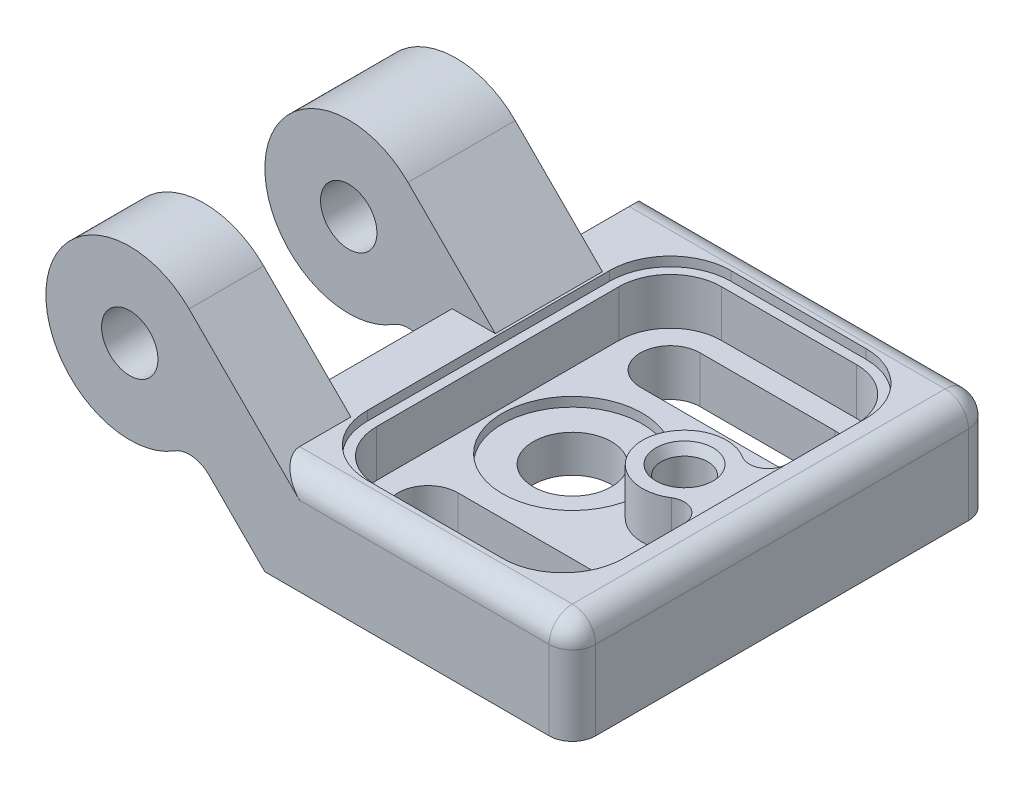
ISO-10303-21;
HEADER;
FILE_DESCRIPTION(('STEP AP214'),'2;1');
FILE_NAME('part.step','',(''),(''),'','','');
FILE_SCHEMA(('AUTOMOTIVE_DESIGN { 1 0 10303 214 1 1 1 1 }'));
ENDSEC;
DATA;
#1=APPLICATION_CONTEXT('core data for automotive mechanical design processes');
#2=APPLICATION_PROTOCOL_DEFINITION('international standard','automotive_design',2000,#1);
#3=PRODUCT_CONTEXT('',#1,'mechanical');
#4=PRODUCT('Part','Part','',(#3));
#5=PRODUCT_RELATED_PRODUCT_CATEGORY('part','',(#4));
#6=PRODUCT_DEFINITION_FORMATION('','',#4);
#7=PRODUCT_DEFINITION_CONTEXT('part definition',#1,'design');
#8=PRODUCT_DEFINITION('design','',#6,#7);
#9=PRODUCT_DEFINITION_SHAPE('','',#8);
#10=(LENGTH_UNIT() NAMED_UNIT(*) SI_UNIT(.MILLI.,.METRE.));
#11=(NAMED_UNIT(*) PLANE_ANGLE_UNIT() SI_UNIT($,.RADIAN.));
#12=(NAMED_UNIT(*) SI_UNIT($,.STERADIAN.) SOLID_ANGLE_UNIT());
#13=UNCERTAINTY_MEASURE_WITH_UNIT(LENGTH_MEASURE(1.E-05),#10,'distance_accuracy_value','');
#14=(GEOMETRIC_REPRESENTATION_CONTEXT(3) GLOBAL_UNCERTAINTY_ASSIGNED_CONTEXT((#13)) GLOBAL_UNIT_ASSIGNED_CONTEXT((#10,
#11,#12)) REPRESENTATION_CONTEXT('',''));
#15=CARTESIAN_POINT('',(0.,0.,0.));
#16=DIRECTION('',(0.,0.,1.));
#17=DIRECTION('',(1.,0.,0.));
#18=AXIS2_PLACEMENT_3D('',#15,#16,#17);
#19=CARTESIAN_POINT('',(6.03589838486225,-3.5,0.));
#20=DIRECTION('',(0.,-1.,0.));
#21=DIRECTION('',(0.,0.,-1.));
#22=AXIS2_PLACEMENT_3D('',#19,#20,#21);
#23=PLANE('',#22);
#24=CARTESIAN_POINT('',(6.03589838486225,-3.5,0.));
#25=DIRECTION('',(0.,-1.,0.));
#26=DIRECTION('',(1.,0.,0.));
#27=AXIS2_PLACEMENT_3D('',#24,#25,#26);
#28=CIRCLE('',#27,2.5);
#29=CARTESIAN_POINT('',(8.53589838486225,-3.5,0.));
#30=VERTEX_POINT('',#29);
#31=EDGE_CURVE('E19',#30,#30,#28,.F.);
#32=ORIENTED_EDGE('',*,*,#31,.T.);
#33=EDGE_LOOP('',(#32));
#34=FACE_BOUND('',#33,.T.);
#35=ADVANCED_FACE('F16',(#34),#23,.F.);
#36=CARTESIAN_POINT('',(6.03589838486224,4.5,0.));
#37=DIRECTION('',(0.,-1.,0.));
#38=DIRECTION('',(1.,0.,0.));
#39=AXIS2_PLACEMENT_3D('',#36,#37,#38);
#40=CYLINDRICAL_SURFACE('',#39,2.5);
#41=CARTESIAN_POINT('',(6.03589838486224,3.49999999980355,0.));
#42=DIRECTION('',(0.,1.,0.));
#43=DIRECTION('',(-1.,0.,0.));
#44=AXIS2_PLACEMENT_3D('',#41,#42,#43);
#45=CIRCLE('',#44,2.50000000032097);
#46=CARTESIAN_POINT('',(3.53589838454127,3.49999999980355,0.));
#47=VERTEX_POINT('',#46);
#48=EDGE_CURVE('E595',#47,#47,#45,.T.);
#49=ORIENTED_EDGE('',*,*,#48,.T.);
#50=EDGE_LOOP('',(#49));
#51=FACE_BOUND('',#50,.T.);
#52=ORIENTED_EDGE('',*,*,#31,.F.);
#53=EDGE_LOOP('',(#52));
#54=FACE_BOUND('',#53,.T.);
#55=ADVANCED_FACE('F1116',(#51,#54),#40,.F.);
#56=CARTESIAN_POINT('',(6.03589838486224,4.50000000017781,0.));
#57=DIRECTION('',(0.,1.,0.));
#58=DIRECTION('',(0.,0.,1.));
#59=AXIS2_PLACEMENT_3D('',#56,#57,#58);
#60=CONICAL_SURFACE('',#59,3.07735026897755,0.523598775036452);
#61=CARTESIAN_POINT('',(6.03589838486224,4.50000000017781,0.));
#62=DIRECTION('',(0.,1.,0.));
#63=DIRECTION('',(0.,0.,1.));
#64=AXIS2_PLACEMENT_3D('',#61,#62,#63);
#65=CIRCLE('',#64,3.07735026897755);
#66=CARTESIAN_POINT('',(6.03589838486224,4.50000000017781,3.07735026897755));
#67=VERTEX_POINT('',#66);
#68=EDGE_CURVE('E333',#67,#67,#65,.F.);
#69=ORIENTED_EDGE('',*,*,#68,.F.);
#70=EDGE_LOOP('',(#69));
#71=FACE_BOUND('',#70,.T.);
#72=ORIENTED_EDGE('',*,*,#48,.F.);
#73=EDGE_LOOP('',(#72));
#74=FACE_BOUND('',#73,.T.);
#75=ADVANCED_FACE('F1113',(#71,#74),#60,.F.);
#76=CARTESIAN_POINT('',(-31.,8.50000000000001,-1.));
#77=DIRECTION('',(0.,0.,-1.));
#78=DIRECTION('',(-1.,0.,0.));
#79=AXIS2_PLACEMENT_3D('',#76,#77,#78);
#80=CYLINDRICAL_SURFACE('',#79,3.025);
#81=CARTESIAN_POINT('',(-31.,8.50000000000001,-1.));
#82=DIRECTION('',(0.,0.,-1.));
#83=DIRECTION('',(-1.,0.,0.));
#84=AXIS2_PLACEMENT_3D('',#81,#82,#83);
#85=CIRCLE('',#84,3.025);
#86=CARTESIAN_POINT('',(-34.025,8.50000000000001,-1.));
#87=VERTEX_POINT('',#86);
#88=EDGE_CURVE('E342',#87,#87,#85,.T.);
#89=ORIENTED_EDGE('',*,*,#88,.F.);
#90=EDGE_LOOP('',(#89));
#91=FACE_BOUND('',#90,.T.);
#92=CARTESIAN_POINT('',(-31.,8.50000000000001,-12.5));
#93=DIRECTION('',(0.,0.,-1.));
#94=DIRECTION('',(-1.,0.,0.));
#95=AXIS2_PLACEMENT_3D('',#92,#93,#94);
#96=CIRCLE('',#95,3.025);
#97=CARTESIAN_POINT('',(-34.025,8.50000000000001,-12.5));
#98=VERTEX_POINT('',#97);
#99=EDGE_CURVE('E349',#98,#98,#96,.T.);
#100=ORIENTED_EDGE('',*,*,#99,.T.);
#101=EDGE_LOOP('',(#100));
#102=FACE_BOUND('',#101,.T.);
#103=ADVANCED_FACE('F1109',(#91,#102),#80,.F.);
#104=CARTESIAN_POINT('',(-15.2720779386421,5.49999999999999,-1.));
#105=DIRECTION('',(0.707106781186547,0.707106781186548,0.));
#106=DIRECTION('',(-0.707106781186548,0.707106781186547,0.));
#107=AXIS2_PLACEMENT_3D('',#104,#105,#106);
#108=PLANE('',#107);
#109=DIRECTION('',(-0.707106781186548,0.707106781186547,0.));
#110=VECTOR('',#109,1.);
#111=CARTESIAN_POINT('',(-15.2720779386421,5.49999999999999,-1.));
#112=LINE('',#111,#110);
#113=CARTESIAN_POINT('',(-15.2720779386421,5.49999999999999,-1.));
#114=VERTEX_POINT('',#113);
#115=CARTESIAN_POINT('',(-24.6360389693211,14.8639610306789,-1.));
#116=VERTEX_POINT('',#115);
#117=EDGE_CURVE('E341',#114,#116,#112,.T.);
#118=ORIENTED_EDGE('',*,*,#117,.F.);
#119=DIRECTION('',(0.,0.,1.));
#120=VECTOR('',#119,1.);
#121=CARTESIAN_POINT('',(-15.2720779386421,5.49999999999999,0.));
#122=LINE('',#121,#120);
#123=CARTESIAN_POINT('',(-15.2720779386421,5.49999999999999,-12.5));
#124=VERTEX_POINT('',#123);
#125=EDGE_CURVE('E603',#124,#114,#122,.T.);
#126=ORIENTED_EDGE('',*,*,#125,.F.);
#127=DIRECTION('',(-0.707106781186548,0.707106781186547,0.));
#128=VECTOR('',#127,1.);
#129=CARTESIAN_POINT('',(-15.2720779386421,5.49999999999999,-12.5));
#130=LINE('',#129,#128);
#131=CARTESIAN_POINT('',(-24.6360389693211,14.8639610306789,-12.5));
#132=VERTEX_POINT('',#131);
#133=EDGE_CURVE('E345',#124,#132,#130,.T.);
#134=ORIENTED_EDGE('',*,*,#133,.T.);
#135=DIRECTION('',(0.,0.,-1.));
#136=VECTOR('',#135,1.);
#137=CARTESIAN_POINT('',(-24.6360389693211,14.8639610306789,-1.));
#138=LINE('',#137,#136);
#139=EDGE_CURVE('E552',#116,#132,#138,.T.);
#140=ORIENTED_EDGE('',*,*,#139,.F.);
#141=EDGE_LOOP('',(#118,#126,#134,#140));
#142=FACE_BOUND('',#141,.T.);
#143=ADVANCED_FACE('F1106',(#142),#108,.T.);
#144=CARTESIAN_POINT('',(-15.,5.49999999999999,-13.));
#145=DIRECTION('',(-1.,0.,0.));
#146=DIRECTION('',(0.,0.,1.));
#147=AXIS2_PLACEMENT_3D('',#144,#145,#146);
#148=PLANE('',#147);
#149=DIRECTION('',(0.,-1.,0.));
#150=VECTOR('',#149,1.);
#151=CARTESIAN_POINT('',(-15.,5.49999999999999,-13.));
#152=LINE('',#151,#150);
#153=CARTESIAN_POINT('',(-15.,4.49999999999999,-13.));
#154=VERTEX_POINT('',#153);
#155=CARTESIAN_POINT('',(-15.,5.49999999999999,-13.));
#156=VERTEX_POINT('',#155);
#157=EDGE_CURVE('E593',#154,#156,#152,.F.);
#158=ORIENTED_EDGE('',*,*,#157,.T.);
#159=DIRECTION('',(0.,0.,1.));
#160=VECTOR('',#159,1.);
#161=CARTESIAN_POINT('',(-15.,5.49999999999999,0.));
#162=LINE('',#161,#160);
#163=CARTESIAN_POINT('',(-15.,5.49999999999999,13.));
#164=VERTEX_POINT('',#163);
#165=EDGE_CURVE('E357',#164,#156,#162,.F.);
#166=ORIENTED_EDGE('',*,*,#165,.F.);
#167=DIRECTION('',(0.,-1.,0.));
#168=VECTOR('',#167,1.);
#169=CARTESIAN_POINT('',(-15.,5.49999999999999,13.));
#170=LINE('',#169,#168);
#171=CARTESIAN_POINT('',(-15.,4.49999999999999,13.));
#172=VERTEX_POINT('',#171);
#173=EDGE_CURVE('E293',#164,#172,#170,.T.);
#174=ORIENTED_EDGE('',*,*,#173,.T.);
#175=DIRECTION('',(0.,0.,1.));
#176=VECTOR('',#175,1.);
#177=CARTESIAN_POINT('',(-15.,4.49999999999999,0.));
#178=LINE('',#177,#176);
#179=EDGE_CURVE('E322',#154,#172,#178,.T.);
#180=ORIENTED_EDGE('',*,*,#179,.F.);
#181=EDGE_LOOP('',(#158,#166,#174,#180));
#182=FACE_BOUND('',#181,.T.);
#183=ADVANCED_FACE('F1102',(#182),#148,.F.);
#184=CARTESIAN_POINT('',(-8.5,5.49999999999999,-13.));
#185=DIRECTION('',(0.,-1.,0.));
#186=DIRECTION('',(0.,0.,-1.));
#187=AXIS2_PLACEMENT_3D('',#184,#185,#186);
#188=CYLINDRICAL_SURFACE('',#187,6.5);
#189=DIRECTION('',(0.,1.,0.));
#190=VECTOR('',#189,1.);
#191=CARTESIAN_POINT('',(-8.5,5.5,-19.5));
#192=LINE('',#191,#190);
#193=CARTESIAN_POINT('',(-8.5,4.49999999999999,-19.5));
#194=VERTEX_POINT('',#193);
#195=CARTESIAN_POINT('',(-8.5,5.49999999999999,-19.5));
#196=VERTEX_POINT('',#195);
#197=EDGE_CURVE('E591',#194,#196,#192,.T.);
#198=ORIENTED_EDGE('',*,*,#197,.T.);
#199=CARTESIAN_POINT('',(-8.5,5.49999999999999,-13.));
#200=DIRECTION('',(0.,-1.,0.));
#201=DIRECTION('',(0.,0.,-1.));
#202=AXIS2_PLACEMENT_3D('',#199,#200,#201);
#203=CIRCLE('',#202,6.5);
#204=EDGE_CURVE('E353',#156,#196,#203,.T.);
#205=ORIENTED_EDGE('',*,*,#204,.F.);
#206=ORIENTED_EDGE('',*,*,#157,.F.);
#207=CARTESIAN_POINT('',(-8.5,4.49999999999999,-13.));
#208=DIRECTION('',(0.,-1.,0.));
#209=DIRECTION('',(0.,0.,-1.));
#210=AXIS2_PLACEMENT_3D('',#207,#208,#209);
#211=CIRCLE('',#210,6.5);
#212=EDGE_CURVE('E331',#194,#154,#211,.F.);
#213=ORIENTED_EDGE('',*,*,#212,.F.);
#214=EDGE_LOOP('',(#198,#205,#206,#213));
#215=FACE_BOUND('',#214,.T.);
#216=ADVANCED_FACE('F1098',(#215),#188,.F.);
#217=CARTESIAN_POINT('',(6.,5.5,-19.5));
#218=DIRECTION('',(0.,0.,-1.));
#219=DIRECTION('',(-1.,0.,0.));
#220=AXIS2_PLACEMENT_3D('',#217,#218,#219);
#221=PLANE('',#220);
#222=DIRECTION('',(0.,-1.,0.));
#223=VECTOR('',#222,1.);
#224=CARTESIAN_POINT('',(6.,5.5,-19.5));
#225=LINE('',#224,#223);
#226=CARTESIAN_POINT('',(6.,4.5,-19.5));
#227=VERTEX_POINT('',#226);
#228=CARTESIAN_POINT('',(6.,5.49999999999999,-19.5));
#229=VERTEX_POINT('',#228);
#230=EDGE_CURVE('E589',#227,#229,#225,.F.);
#231=ORIENTED_EDGE('',*,*,#230,.T.);
#232=DIRECTION('',(1.,0.,0.));
#233=VECTOR('',#232,1.);
#234=CARTESIAN_POINT('',(-19.9,5.49999999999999,-19.5));
#235=LINE('',#234,#233);
#236=EDGE_CURVE('E356',#196,#229,#235,.T.);
#237=ORIENTED_EDGE('',*,*,#236,.F.);
#238=ORIENTED_EDGE('',*,*,#197,.F.);
#239=DIRECTION('',(1.,0.,0.));
#240=VECTOR('',#239,1.);
#241=CARTESIAN_POINT('',(-1.24999999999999,4.49999999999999,-19.5));
#242=LINE('',#241,#240);
#243=EDGE_CURVE('E330',#227,#194,#242,.F.);
#244=ORIENTED_EDGE('',*,*,#243,.F.);
#245=EDGE_LOOP('',(#231,#237,#238,#244));
#246=FACE_BOUND('',#245,.T.);
#247=ADVANCED_FACE('F1094',(#246),#221,.F.);
#248=CARTESIAN_POINT('',(6.,5.5,-13.));
#249=DIRECTION('',(0.,-1.,0.));
#250=DIRECTION('',(0.,0.,-1.));
#251=AXIS2_PLACEMENT_3D('',#248,#249,#250);
#252=CYLINDRICAL_SURFACE('',#251,6.5);
#253=DIRECTION('',(0.,1.,0.));
#254=VECTOR('',#253,1.);
#255=CARTESIAN_POINT('',(12.5,5.5,-13.));
#256=LINE('',#255,#254);
#257=CARTESIAN_POINT('',(12.5,4.5,-13.));
#258=VERTEX_POINT('',#257);
#259=CARTESIAN_POINT('',(12.5,5.49999999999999,-13.));
#260=VERTEX_POINT('',#259);
#261=EDGE_CURVE('E587',#258,#260,#256,.T.);
#262=ORIENTED_EDGE('',*,*,#261,.T.);
#263=CARTESIAN_POINT('',(6.,5.5,-13.));
#264=DIRECTION('',(0.,-1.,0.));
#265=DIRECTION('',(0.,0.,-1.));
#266=AXIS2_PLACEMENT_3D('',#263,#264,#265);
#267=CIRCLE('',#266,6.5);
#268=EDGE_CURVE('E358',#229,#260,#267,.T.);
#269=ORIENTED_EDGE('',*,*,#268,.F.);
#270=ORIENTED_EDGE('',*,*,#230,.F.);
#271=CARTESIAN_POINT('',(6.,4.5,-13.));
#272=DIRECTION('',(0.,-1.,0.));
#273=DIRECTION('',(0.,0.,-1.));
#274=AXIS2_PLACEMENT_3D('',#271,#272,#273);
#275=CIRCLE('',#274,6.5);
#276=EDGE_CURVE('E327',#258,#227,#275,.F.);
#277=ORIENTED_EDGE('',*,*,#276,.F.);
#278=EDGE_LOOP('',(#262,#269,#270,#277));
#279=FACE_BOUND('',#278,.T.);
#280=ADVANCED_FACE('F1090',(#279),#252,.F.);
#281=CARTESIAN_POINT('',(12.5,5.5,13.));
#282=DIRECTION('',(1.,0.,0.));
#283=DIRECTION('',(0.,0.,-1.));
#284=AXIS2_PLACEMENT_3D('',#281,#282,#283);
#285=PLANE('',#284);
#286=DIRECTION('',(0.,-1.,0.));
#287=VECTOR('',#286,1.);
#288=CARTESIAN_POINT('',(12.5,5.5,13.));
#289=LINE('',#288,#287);
#290=CARTESIAN_POINT('',(12.5,4.5,13.));
#291=VERTEX_POINT('',#290);
#292=CARTESIAN_POINT('',(12.5,5.49999999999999,13.));
#293=VERTEX_POINT('',#292);
#294=EDGE_CURVE('E585',#291,#293,#289,.F.);
#295=ORIENTED_EDGE('',*,*,#294,.T.);
#296=DIRECTION('',(0.,0.,1.));
#297=VECTOR('',#296,1.);
#298=CARTESIAN_POINT('',(12.5,5.49999999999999,0.));
#299=LINE('',#298,#297);
#300=EDGE_CURVE('E361',#260,#293,#299,.T.);
#301=ORIENTED_EDGE('',*,*,#300,.F.);
#302=ORIENTED_EDGE('',*,*,#261,.F.);
#303=DIRECTION('',(0.,0.,1.));
#304=VECTOR('',#303,1.);
#305=CARTESIAN_POINT('',(12.5,4.49999999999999,0.));
#306=LINE('',#305,#304);
#307=EDGE_CURVE('E326',#291,#258,#306,.F.);
#308=ORIENTED_EDGE('',*,*,#307,.F.);
#309=EDGE_LOOP('',(#295,#301,#302,#308));
#310=FACE_BOUND('',#309,.T.);
#311=ADVANCED_FACE('F1086',(#310),#285,.F.);
#312=CARTESIAN_POINT('',(6.00000000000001,5.5,13.));
#313=DIRECTION('',(0.,-1.,0.));
#314=DIRECTION('',(0.,0.,-1.));
#315=AXIS2_PLACEMENT_3D('',#312,#313,#314);
#316=CYLINDRICAL_SURFACE('',#315,6.5);
#317=DIRECTION('',(0.,1.,0.));
#318=VECTOR('',#317,1.);
#319=CARTESIAN_POINT('',(6.00000000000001,5.49999999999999,19.5));
#320=LINE('',#319,#318);
#321=CARTESIAN_POINT('',(6.00000000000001,4.49999999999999,19.5));
#322=VERTEX_POINT('',#321);
#323=CARTESIAN_POINT('',(6.00000000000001,5.49999999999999,19.5));
#324=VERTEX_POINT('',#323);
#325=EDGE_CURVE('E309',#322,#324,#320,.T.);
#326=ORIENTED_EDGE('',*,*,#325,.T.);
#327=CARTESIAN_POINT('',(6.00000000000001,5.5,13.));
#328=DIRECTION('',(0.,-1.,0.));
#329=DIRECTION('',(0.,0.,-1.));
#330=AXIS2_PLACEMENT_3D('',#327,#328,#329);
#331=CIRCLE('',#330,6.5);
#332=EDGE_CURVE('E362',#293,#324,#331,.T.);
#333=ORIENTED_EDGE('',*,*,#332,.F.);
#334=ORIENTED_EDGE('',*,*,#294,.F.);
#335=CARTESIAN_POINT('',(6.00000000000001,4.5,13.));
#336=DIRECTION('',(0.,-1.,0.));
#337=DIRECTION('',(0.,0.,-1.));
#338=AXIS2_PLACEMENT_3D('',#335,#336,#337);
#339=CIRCLE('',#338,6.5);
#340=EDGE_CURVE('E317',#322,#291,#339,.F.);
#341=ORIENTED_EDGE('',*,*,#340,.F.);
#342=EDGE_LOOP('',(#326,#333,#334,#341));
#343=FACE_BOUND('',#342,.T.);
#344=ADVANCED_FACE('F1083',(#343),#316,.F.);
#345=CARTESIAN_POINT('',(-8.49999999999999,5.49999999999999,19.5));
#346=DIRECTION('',(0.,0.,1.));
#347=DIRECTION('',(1.,0.,0.));
#348=AXIS2_PLACEMENT_3D('',#345,#346,#347);
#349=PLANE('',#348);
#350=DIRECTION('',(0.,-1.,0.));
#351=VECTOR('',#350,1.);
#352=CARTESIAN_POINT('',(-8.5,5.49999999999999,19.5));
#353=LINE('',#352,#351);
#354=CARTESIAN_POINT('',(-8.5,4.49999999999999,19.5));
#355=VERTEX_POINT('',#354);
#356=CARTESIAN_POINT('',(-8.5,5.49999999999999,19.5));
#357=VERTEX_POINT('',#356);
#358=EDGE_CURVE('E298',#355,#357,#353,.F.);
#359=ORIENTED_EDGE('',*,*,#358,.T.);
#360=DIRECTION('',(1.,0.,0.));
#361=VECTOR('',#360,1.);
#362=CARTESIAN_POINT('',(-19.9,5.49999999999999,19.5));
#363=LINE('',#362,#361);
#364=EDGE_CURVE('E365',#324,#357,#363,.F.);
#365=ORIENTED_EDGE('',*,*,#364,.F.);
#366=ORIENTED_EDGE('',*,*,#325,.F.);
#367=DIRECTION('',(1.,0.,0.));
#368=VECTOR('',#367,1.);
#369=CARTESIAN_POINT('',(-1.24999999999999,4.49999999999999,19.5));
#370=LINE('',#369,#368);
#371=EDGE_CURVE('E312',#355,#322,#370,.T.);
#372=ORIENTED_EDGE('',*,*,#371,.F.);
#373=EDGE_LOOP('',(#359,#365,#366,#372));
#374=FACE_BOUND('',#373,.T.);
#375=ADVANCED_FACE('F313',(#374),#349,.F.);
#376=CARTESIAN_POINT('',(-8.5,5.49999999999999,13.));
#377=DIRECTION('',(0.,-1.,0.));
#378=DIRECTION('',(0.,0.,-1.));
#379=AXIS2_PLACEMENT_3D('',#376,#377,#378);
#380=CYLINDRICAL_SURFACE('',#379,6.5);
#381=ORIENTED_EDGE('',*,*,#173,.F.);
#382=CARTESIAN_POINT('',(-8.5,5.49999999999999,13.));
#383=DIRECTION('',(0.,-1.,0.));
#384=DIRECTION('',(0.,0.,-1.));
#385=AXIS2_PLACEMENT_3D('',#382,#383,#384);
#386=CIRCLE('',#385,6.5);
#387=EDGE_CURVE('E305',#357,#164,#386,.T.);
#388=ORIENTED_EDGE('',*,*,#387,.F.);
#389=ORIENTED_EDGE('',*,*,#358,.F.);
#390=CARTESIAN_POINT('',(-8.5,4.49999999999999,13.));
#391=DIRECTION('',(0.,-1.,0.));
#392=DIRECTION('',(0.,0.,-1.));
#393=AXIS2_PLACEMENT_3D('',#390,#391,#392);
#394=CIRCLE('',#393,6.5);
#395=EDGE_CURVE('E302',#172,#355,#394,.F.);
#396=ORIENTED_EDGE('',*,*,#395,.F.);
#397=EDGE_LOOP('',(#381,#388,#389,#396));
#398=FACE_BOUND('',#397,.T.);
#399=ADVANCED_FACE('F300',(#398),#380,.F.);
#400=CARTESIAN_POINT('',(-1.24999999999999,4.49999999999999,0.));
#401=DIRECTION('',(0.,1.,0.));
#402=DIRECTION('',(0.,0.,1.));
#403=AXIS2_PLACEMENT_3D('',#400,#401,#402);
#404=PLANE('',#403);
#405=ORIENTED_EDGE('',*,*,#68,.T.);
#406=EDGE_LOOP('',(#405));
#407=FACE_BOUND('',#406,.T.);
#408=CARTESIAN_POINT('',(6.00000000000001,4.49999999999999,13.));
#409=DIRECTION('',(0.,-1.,0.));
#410=DIRECTION('',(1.,0.,0.));
#411=AXIS2_PLACEMENT_3D('',#408,#409,#410);
#412=CIRCLE('',#411,5.5);
#413=CARTESIAN_POINT('',(11.5,4.5,13.));
#414=VERTEX_POINT('',#413);
#415=CARTESIAN_POINT('',(6.00000000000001,4.5,18.5));
#416=VERTEX_POINT('',#415);
#417=EDGE_CURVE('E370',#414,#416,#412,.T.);
#418=ORIENTED_EDGE('',*,*,#417,.T.);
#419=DIRECTION('',(1.,0.,0.));
#420=VECTOR('',#419,1.);
#421=CARTESIAN_POINT('',(-8.49999999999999,4.5,18.5));
#422=LINE('',#421,#420);
#423=CARTESIAN_POINT('',(-8.5,4.49999999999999,18.5));
#424=VERTEX_POINT('',#423);
#425=EDGE_CURVE('E369',#416,#424,#422,.F.);
#426=ORIENTED_EDGE('',*,*,#425,.T.);
#427=CARTESIAN_POINT('',(-8.5,4.49999999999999,13.));
#428=DIRECTION('',(0.,-1.,0.));
#429=DIRECTION('',(1.,0.,0.));
#430=AXIS2_PLACEMENT_3D('',#427,#428,#429);
#431=CIRCLE('',#430,5.5);
#432=CARTESIAN_POINT('',(-14.,4.49999999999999,13.));
#433=VERTEX_POINT('',#432);
#434=EDGE_CURVE('E367',#424,#433,#431,.T.);
#435=ORIENTED_EDGE('',*,*,#434,.T.);
#436=DIRECTION('',(0.,0.,1.));
#437=VECTOR('',#436,1.);
#438=CARTESIAN_POINT('',(-14.,4.49999999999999,-13.));
#439=LINE('',#438,#437);
#440=CARTESIAN_POINT('',(-14.,4.49999999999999,-13.));
#441=VERTEX_POINT('',#440);
#442=EDGE_CURVE('E487',#433,#441,#439,.F.);
#443=ORIENTED_EDGE('',*,*,#442,.T.);
#444=CARTESIAN_POINT('',(-8.5,4.49999999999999,-13.));
#445=DIRECTION('',(0.,-1.,0.));
#446=DIRECTION('',(1.,0.,0.));
#447=AXIS2_PLACEMENT_3D('',#444,#445,#446);
#448=CIRCLE('',#447,5.5);
#449=CARTESIAN_POINT('',(-8.5,4.49999999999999,-18.5));
#450=VERTEX_POINT('',#449);
#451=EDGE_CURVE('E389',#441,#450,#448,.T.);
#452=ORIENTED_EDGE('',*,*,#451,.T.);
#453=DIRECTION('',(-1.,0.,0.));
#454=VECTOR('',#453,1.);
#455=CARTESIAN_POINT('',(6.,4.49999999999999,-18.5));
#456=LINE('',#455,#454);
#457=CARTESIAN_POINT('',(6.,4.49999999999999,-18.5));
#458=VERTEX_POINT('',#457);
#459=EDGE_CURVE('E493',#450,#458,#456,.F.);
#460=ORIENTED_EDGE('',*,*,#459,.T.);
#461=CARTESIAN_POINT('',(6.,4.5,-13.));
#462=DIRECTION('',(0.,-1.,0.));
#463=DIRECTION('',(1.,0.,0.));
#464=AXIS2_PLACEMENT_3D('',#461,#462,#463);
#465=CIRCLE('',#464,5.5);
#466=CARTESIAN_POINT('',(11.5,4.5,-13.));
#467=VERTEX_POINT('',#466);
#468=EDGE_CURVE('E385',#458,#467,#465,.T.);
#469=ORIENTED_EDGE('',*,*,#468,.T.);
#470=DIRECTION('',(0.,0.,-1.));
#471=VECTOR('',#470,1.);
#472=CARTESIAN_POINT('',(11.5,4.5,-5.50000000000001));
#473=LINE('',#472,#471);
#474=CARTESIAN_POINT('',(11.5,4.5,-5.50000000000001));
#475=VERTEX_POINT('',#474);
#476=EDGE_CURVE('E496',#467,#475,#473,.F.);
#477=ORIENTED_EDGE('',*,*,#476,.T.);
#478=CARTESIAN_POINT('',(9.5,4.5,-5.50000000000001));
#479=DIRECTION('',(0.,-1.,0.));
#480=DIRECTION('',(1.,0.,0.));
#481=AXIS2_PLACEMENT_3D('',#478,#479,#480);
#482=CIRCLE('',#481,2.);
#483=CARTESIAN_POINT('',(8.43412257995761,4.5,-3.80769230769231));
#484=VERTEX_POINT('',#483);
#485=EDGE_CURVE('E381',#475,#484,#482,.T.);
#486=ORIENTED_EDGE('',*,*,#485,.T.);
#487=CARTESIAN_POINT('',(6.03589838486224,4.49999999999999,0.));
#488=DIRECTION('',(0.,-1.,0.));
#489=DIRECTION('',(1.,0.,0.));
#490=AXIS2_PLACEMENT_3D('',#487,#488,#489);
#491=CIRCLE('',#490,4.5);
#492=CARTESIAN_POINT('',(8.43412257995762,4.5,3.8076923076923));
#493=VERTEX_POINT('',#492);
#494=EDGE_CURVE('E378',#493,#484,#491,.T.);
#495=ORIENTED_EDGE('',*,*,#494,.F.);
#496=CARTESIAN_POINT('',(9.50000000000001,4.5,5.5));
#497=DIRECTION('',(0.,-1.,0.));
#498=DIRECTION('',(1.,0.,0.));
#499=AXIS2_PLACEMENT_3D('',#496,#497,#498);
#500=CIRCLE('',#499,2.);
#501=CARTESIAN_POINT('',(11.5,4.5,5.5));
#502=VERTEX_POINT('',#501);
#503=EDGE_CURVE('E374',#493,#502,#500,.T.);
#504=ORIENTED_EDGE('',*,*,#503,.T.);
#505=DIRECTION('',(0.,0.,-1.));
#506=VECTOR('',#505,1.);
#507=CARTESIAN_POINT('',(11.5,4.5,13.));
#508=LINE('',#507,#506);
#509=EDGE_CURVE('E502',#502,#414,#508,.F.);
#510=ORIENTED_EDGE('',*,*,#509,.T.);
#511=EDGE_LOOP('',(#418,#426,#435,#443,#452,#460,#469,#477,#486,#495,#504,#510));
#512=FACE_BOUND('',#511,.T.);
#513=ORIENTED_EDGE('',*,*,#243,.T.);
#514=ORIENTED_EDGE('',*,*,#212,.T.);
#515=ORIENTED_EDGE('',*,*,#179,.T.);
#516=ORIENTED_EDGE('',*,*,#395,.T.);
#517=ORIENTED_EDGE('',*,*,#371,.T.);
#518=ORIENTED_EDGE('',*,*,#340,.T.);
#519=ORIENTED_EDGE('',*,*,#307,.T.);
#520=ORIENTED_EDGE('',*,*,#276,.T.);
#521=EDGE_LOOP('',(#513,#514,#515,#516,#517,#518,#519,#520));
#522=FACE_BOUND('',#521,.T.);
#523=ADVANCED_FACE('F320',(#407,#512,#522),#404,.T.);
#524=CARTESIAN_POINT('',(-28.0249746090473,7.78989026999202,14.5));
#525=DIRECTION('',(0.,0.,1.));
#526=DIRECTION('',(1.,0.,0.));
#527=AXIS2_PLACEMENT_3D('',#524,#525,#526);
#528=PLANE('',#527);
#529=CARTESIAN_POINT('',(-31.,8.50000000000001,14.5));
#530=DIRECTION('',(0.,0.,-1.));
#531=DIRECTION('',(-1.,0.,0.));
#532=AXIS2_PLACEMENT_3D('',#529,#530,#531);
#533=CIRCLE('',#532,3.025);
#534=CARTESIAN_POINT('',(-34.025,8.50000000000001,14.5));
#535=VERTEX_POINT('',#534);
#536=EDGE_CURVE('E400',#535,#535,#533,.F.);
#537=ORIENTED_EDGE('',*,*,#536,.T.);
#538=EDGE_LOOP('',(#537));
#539=FACE_BOUND('',#538,.T.);
#540=CARTESIAN_POINT('',(-20.8715728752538,1.69999999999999,14.5));
#541=DIRECTION('',(0.,0.,1.));
#542=DIRECTION('',(1.,0.,0.));
#543=AXIS2_PLACEMENT_3D('',#540,#541,#542);
#544=CIRCLE('',#543,2.);
#545=CARTESIAN_POINT('',(-22.2857864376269,0.285786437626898,14.5));
#546=VERTEX_POINT('',#545);
#547=CARTESIAN_POINT('',(-22.2857864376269,3.11421356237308,14.5));
#548=VERTEX_POINT('',#547);
#549=EDGE_CURVE('E411',#546,#548,#544,.F.);
#550=ORIENTED_EDGE('',*,*,#549,.F.);
#551=DIRECTION('',(0.707106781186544,-0.707106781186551,0.));
#552=VECTOR('',#551,1.);
#553=CARTESIAN_POINT('',(-22.4736384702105,0.473638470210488,14.5));
#554=LINE('',#553,#552);
#555=CARTESIAN_POINT('',(-22.4736384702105,0.473638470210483,14.5));
#556=VERTEX_POINT('',#555);
#557=EDGE_CURVE('E336',#556,#546,#554,.T.);
#558=ORIENTED_EDGE('',*,*,#557,.F.);
#559=CARTESIAN_POINT('',(-24.5949588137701,-1.64768187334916,14.5));
#560=DIRECTION('',(0.,0.,-1.));
#561=DIRECTION('',(-1.,0.,0.));
#562=AXIS2_PLACEMENT_3D('',#559,#560,#561);
#563=CIRCLE('',#562,3.);
#564=CARTESIAN_POINT('',(-26.1962191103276,0.889238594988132,14.5));
#565=VERTEX_POINT('',#564);
#566=EDGE_CURVE('E405',#556,#565,#563,.F.);
#567=ORIENTED_EDGE('',*,*,#566,.T.);
#568=CARTESIAN_POINT('',(-31.,8.50000000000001,14.5));
#569=DIRECTION('',(0.,0.,-1.));
#570=DIRECTION('',(-1.,0.,0.));
#571=AXIS2_PLACEMENT_3D('',#568,#569,#570);
#572=CIRCLE('',#571,9.);
#573=CARTESIAN_POINT('',(-24.6360389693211,14.8639610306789,14.5));
#574=VERTEX_POINT('',#573);
#575=EDGE_CURVE('E393',#574,#565,#572,.F.);
#576=ORIENTED_EDGE('',*,*,#575,.F.);
#577=DIRECTION('',(-0.707106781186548,0.707106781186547,0.));
#578=VECTOR('',#577,1.);
#579=CARTESIAN_POINT('',(-15.2720779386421,5.49999999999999,14.5));
#580=LINE('',#579,#578);
#581=CARTESIAN_POINT('',(-15.2720779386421,5.49999999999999,14.5));
#582=VERTEX_POINT('',#581);
#583=EDGE_CURVE('E486',#582,#574,#580,.T.);
#584=ORIENTED_EDGE('',*,*,#583,.F.);
#585=DIRECTION('',(1.,0.,0.));
#586=VECTOR('',#585,1.);
#587=CARTESIAN_POINT('',(-19.9,5.49999999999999,14.5));
#588=LINE('',#587,#586);
#589=CARTESIAN_POINT('',(-19.9,5.49999999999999,14.5));
#590=VERTEX_POINT('',#589);
#591=EDGE_CURVE('E512',#590,#582,#588,.T.);
#592=ORIENTED_EDGE('',*,*,#591,.F.);
#593=DIRECTION('',(-0.707106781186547,-0.707106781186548,0.));
#594=VECTOR('',#593,1.);
#595=CARTESIAN_POINT('',(-22.2857864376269,3.11421356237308,14.5));
#596=LINE('',#595,#594);
#597=EDGE_CURVE('E556',#548,#590,#596,.F.);
#598=ORIENTED_EDGE('',*,*,#597,.F.);
#599=EDGE_LOOP('',(#550,#558,#567,#576,#584,#592,#598));
#600=FACE_BOUND('',#599,.T.);
#601=ADVANCED_FACE('F942',(#539,#600),#528,.F.);
#602=CARTESIAN_POINT('',(-22.2857864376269,3.11421356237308,0.));
#603=DIRECTION('',(-0.707106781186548,0.707106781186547,0.));
#604=DIRECTION('',(-0.707106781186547,-0.707106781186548,0.));
#605=AXIS2_PLACEMENT_3D('',#602,#603,#604);
#606=PLANE('',#605);
#607=ORIENTED_EDGE('',*,*,#597,.T.);
#608=DIRECTION('',(0.,0.,1.));
#609=VECTOR('',#608,1.);
#610=CARTESIAN_POINT('',(-19.9,5.49999999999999,0.));
#611=LINE('',#610,#609);
#612=CARTESIAN_POINT('',(-19.9,5.49999999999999,-1.));
#613=VERTEX_POINT('',#612);
#614=EDGE_CURVE('E572',#613,#590,#611,.T.);
#615=ORIENTED_EDGE('',*,*,#614,.F.);
#616=DIRECTION('',(0.707106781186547,0.707106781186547,0.));
#617=VECTOR('',#616,1.);
#618=CARTESIAN_POINT('',(-22.2857864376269,3.11421356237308,-1.));
#619=LINE('',#618,#617);
#620=CARTESIAN_POINT('',(-22.2857864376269,3.11421356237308,-1.));
#621=VERTEX_POINT('',#620);
#622=EDGE_CURVE('E547',#621,#613,#619,.T.);
#623=ORIENTED_EDGE('',*,*,#622,.F.);
#624=DIRECTION('',(0.,0.,1.));
#625=VECTOR('',#624,1.);
#626=CARTESIAN_POINT('',(-22.2857864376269,3.11421356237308,0.));
#627=LINE('',#626,#625);
#628=EDGE_CURVE('E414',#548,#621,#627,.F.);
#629=ORIENTED_EDGE('',*,*,#628,.F.);
#630=EDGE_LOOP('',(#607,#615,#623,#629));
#631=FACE_BOUND('',#630,.T.);
#632=ADVANCED_FACE('F1075',(#631),#606,.T.);
#633=CARTESIAN_POINT('',(-31.,8.50000000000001,-1.));
#634=DIRECTION('',(0.,0.,-1.));
#635=DIRECTION('',(-1.,0.,0.));
#636=AXIS2_PLACEMENT_3D('',#633,#634,#635);
#637=CYLINDRICAL_SURFACE('',#636,9.);
#638=CARTESIAN_POINT('',(-31.,8.50000000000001,-1.));
#639=DIRECTION('',(0.,0.,-1.));
#640=DIRECTION('',(-1.,0.,0.));
#641=AXIS2_PLACEMENT_3D('',#638,#639,#640);
#642=CIRCLE('',#641,9.);
#643=CARTESIAN_POINT('',(-26.1962191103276,0.889238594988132,-1.));
#644=VERTEX_POINT('',#643);
#645=EDGE_CURVE('E337',#116,#644,#642,.F.);
#646=ORIENTED_EDGE('',*,*,#645,.F.);
#647=ORIENTED_EDGE('',*,*,#139,.T.);
#648=CARTESIAN_POINT('',(-31.,8.50000000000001,-12.5));
#649=DIRECTION('',(0.,0.,-1.));
#650=DIRECTION('',(-1.,0.,0.));
#651=AXIS2_PLACEMENT_3D('',#648,#649,#650);
#652=CIRCLE('',#651,9.);
#653=CARTESIAN_POINT('',(-26.1962191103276,0.889238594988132,-12.5));
#654=VERTEX_POINT('',#653);
#655=EDGE_CURVE('E346',#132,#654,#652,.F.);
#656=ORIENTED_EDGE('',*,*,#655,.T.);
#657=DIRECTION('',(0.,0.,-1.));
#658=VECTOR('',#657,1.);
#659=CARTESIAN_POINT('',(-26.1962191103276,0.889238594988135,-1.));
#660=LINE('',#659,#658);
#661=EDGE_CURVE('E419',#654,#644,#660,.F.);
#662=ORIENTED_EDGE('',*,*,#661,.T.);
#663=EDGE_LOOP('',(#646,#647,#656,#662));
#664=FACE_BOUND('',#663,.T.);
#665=ADVANCED_FACE('F1195',(#664),#637,.T.);
#666=CARTESIAN_POINT('',(-28.0249746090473,7.78989026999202,-1.));
#667=DIRECTION('',(0.,0.,1.));
#668=DIRECTION('',(1.,0.,0.));
#669=AXIS2_PLACEMENT_3D('',#666,#667,#668);
#670=PLANE('',#669);
#671=ORIENTED_EDGE('',*,*,#88,.T.);
#672=EDGE_LOOP('',(#671));
#673=FACE_BOUND('',#672,.T.);
#674=DIRECTION('',(0.707106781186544,-0.707106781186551,0.));
#675=VECTOR('',#674,1.);
#676=CARTESIAN_POINT('',(-22.4736384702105,0.473638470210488,-1.));
#677=LINE('',#676,#675);
#678=CARTESIAN_POINT('',(-22.4736384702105,0.473638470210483,-1.));
#679=VERTEX_POINT('',#678);
#680=CARTESIAN_POINT('',(-22.2857864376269,0.285786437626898,-1.));
#681=VERTEX_POINT('',#680);
#682=EDGE_CURVE('E340',#679,#681,#677,.T.);
#683=ORIENTED_EDGE('',*,*,#682,.T.);
#684=CARTESIAN_POINT('',(-20.8715728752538,1.69999999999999,-1.));
#685=DIRECTION('',(0.,0.,1.));
#686=DIRECTION('',(1.,0.,0.));
#687=AXIS2_PLACEMENT_3D('',#684,#685,#686);
#688=CIRCLE('',#687,2.);
#689=EDGE_CURVE('E408',#621,#681,#688,.T.);
#690=ORIENTED_EDGE('',*,*,#689,.F.);
#691=ORIENTED_EDGE('',*,*,#622,.T.);
#692=DIRECTION('',(1.,0.,0.));
#693=VECTOR('',#692,1.);
#694=CARTESIAN_POINT('',(-19.9,5.49999999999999,-1.));
#695=LINE('',#694,#693);
#696=EDGE_CURVE('E598',#114,#613,#695,.F.);
#697=ORIENTED_EDGE('',*,*,#696,.F.);
#698=ORIENTED_EDGE('',*,*,#117,.T.);
#699=ORIENTED_EDGE('',*,*,#645,.T.);
#700=CARTESIAN_POINT('',(-24.5949588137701,-1.64768187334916,-1.));
#701=DIRECTION('',(0.,0.,-1.));
#702=DIRECTION('',(-1.,0.,0.));
#703=AXIS2_PLACEMENT_3D('',#700,#701,#702);
#704=CIRCLE('',#703,3.00000000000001);
#705=EDGE_CURVE('E415',#644,#679,#704,.T.);
#706=ORIENTED_EDGE('',*,*,#705,.T.);
#707=EDGE_LOOP('',(#683,#690,#691,#697,#698,#699,#706));
#708=FACE_BOUND('',#707,.T.);
#709=ADVANCED_FACE('F1201',(#673,#708),#670,.T.);
#710=CARTESIAN_POINT('',(-28.0249746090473,7.78989026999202,-12.5));
#711=DIRECTION('',(0.,0.,1.));
#712=DIRECTION('',(1.,0.,0.));
#713=AXIS2_PLACEMENT_3D('',#710,#711,#712);
#714=PLANE('',#713);
#715=ORIENTED_EDGE('',*,*,#99,.F.);
#716=EDGE_LOOP('',(#715));
#717=FACE_BOUND('',#716,.T.);
#718=DIRECTION('',(-0.707106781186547,-0.707106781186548,0.));
#719=VECTOR('',#718,1.);
#720=CARTESIAN_POINT('',(-22.2857864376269,3.11421356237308,-12.5));
#721=LINE('',#720,#719);
#722=CARTESIAN_POINT('',(-22.2857864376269,3.11421356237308,-12.5));
#723=VERTEX_POINT('',#722);
#724=CARTESIAN_POINT('',(-19.9,5.49999999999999,-12.5));
#725=VERTEX_POINT('',#724);
#726=EDGE_CURVE('E352',#723,#725,#721,.F.);
#727=ORIENTED_EDGE('',*,*,#726,.F.);
#728=CARTESIAN_POINT('',(-20.8715728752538,1.69999999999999,-12.5));
#729=DIRECTION('',(0.,0.,1.));
#730=DIRECTION('',(1.,0.,0.));
#731=AXIS2_PLACEMENT_3D('',#728,#729,#730);
#732=CIRCLE('',#731,2.);
#733=CARTESIAN_POINT('',(-22.2857864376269,0.285786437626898,-12.5));
#734=VERTEX_POINT('',#733);
#735=EDGE_CURVE('E434',#734,#723,#732,.F.);
#736=ORIENTED_EDGE('',*,*,#735,.F.);
#737=DIRECTION('',(0.707106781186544,-0.707106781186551,0.));
#738=VECTOR('',#737,1.);
#739=CARTESIAN_POINT('',(-22.4736384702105,0.473638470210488,-12.5));
#740=LINE('',#739,#738);
#741=CARTESIAN_POINT('',(-22.4736384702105,0.473638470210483,-12.5));
#742=VERTEX_POINT('',#741);
#743=EDGE_CURVE('E348',#742,#734,#740,.T.);
#744=ORIENTED_EDGE('',*,*,#743,.F.);
#745=CARTESIAN_POINT('',(-24.5949588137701,-1.64768187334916,-12.5));
#746=DIRECTION('',(0.,0.,-1.));
#747=DIRECTION('',(-1.,0.,0.));
#748=AXIS2_PLACEMENT_3D('',#745,#746,#747);
#749=CIRCLE('',#748,3.00000000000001);
#750=EDGE_CURVE('E418',#742,#654,#749,.F.);
#751=ORIENTED_EDGE('',*,*,#750,.T.);
#752=ORIENTED_EDGE('',*,*,#655,.F.);
#753=ORIENTED_EDGE('',*,*,#133,.F.);
#754=DIRECTION('',(1.,0.,0.));
#755=VECTOR('',#754,1.);
#756=CARTESIAN_POINT('',(-19.9,5.49999999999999,-12.5));
#757=LINE('',#756,#755);
#758=EDGE_CURVE('E535',#725,#124,#757,.T.);
#759=ORIENTED_EDGE('',*,*,#758,.F.);
#760=EDGE_LOOP('',(#727,#736,#744,#751,#752,#753,#759));
#761=FACE_BOUND('',#760,.T.);
#762=ADVANCED_FACE('F1209',(#717,#761),#714,.F.);
#763=CARTESIAN_POINT('',(-22.2857864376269,3.11421356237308,0.));
#764=DIRECTION('',(-0.707106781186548,0.707106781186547,0.));
#765=DIRECTION('',(-0.707106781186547,-0.707106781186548,0.));
#766=AXIS2_PLACEMENT_3D('',#763,#764,#765);
#767=PLANE('',#766);
#768=ORIENTED_EDGE('',*,*,#726,.T.);
#769=DIRECTION('',(0.,0.,1.));
#770=VECTOR('',#769,1.);
#771=CARTESIAN_POINT('',(-19.9,5.49999999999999,0.));
#772=LINE('',#771,#770);
#773=CARTESIAN_POINT('',(-19.9,5.49999999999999,-20.));
#774=VERTEX_POINT('',#773);
#775=EDGE_CURVE('E526',#774,#725,#772,.T.);
#776=ORIENTED_EDGE('',*,*,#775,.F.);
#777=CARTESIAN_POINT('',(-22.4,2.99999999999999,-20.));
#778=DIRECTION('',(-0.707106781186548,0.707106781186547,0.));
#779=DIRECTION('',(-0.707106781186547,-0.707106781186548,0.));
#780=AXIS2_PLACEMENT_3D('',#777,#778,#779);
#781=ELLIPSE('',#780,3.53553390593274,2.5);
#782=CARTESIAN_POINT('',(-22.2857864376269,3.11421356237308,-22.49738968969));
#783=VERTEX_POINT('',#782);
#784=EDGE_CURVE('E422',#783,#774,#781,.F.);
#785=ORIENTED_EDGE('',*,*,#784,.F.);
#786=DIRECTION('',(0.,0.,1.));
#787=VECTOR('',#786,1.);
#788=CARTESIAN_POINT('',(-22.2857864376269,3.11421356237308,0.));
#789=LINE('',#788,#787);
#790=EDGE_CURVE('E520',#723,#783,#789,.F.);
#791=ORIENTED_EDGE('',*,*,#790,.F.);
#792=EDGE_LOOP('',(#768,#776,#785,#791));
#793=FACE_BOUND('',#792,.T.);
#794=ADVANCED_FACE('F1217',(#793),#767,.T.);
#795=CARTESIAN_POINT('',(-19.9,5.49999999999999,0.));
#796=DIRECTION('',(0.,1.,0.));
#797=DIRECTION('',(0.,0.,1.));
#798=AXIS2_PLACEMENT_3D('',#795,#796,#797);
#799=PLANE('',#798);
#800=ORIENTED_EDGE('',*,*,#364,.T.);
#801=ORIENTED_EDGE('',*,*,#387,.T.);
#802=ORIENTED_EDGE('',*,*,#165,.T.);
#803=ORIENTED_EDGE('',*,*,#204,.T.);
#804=ORIENTED_EDGE('',*,*,#236,.T.);
#805=ORIENTED_EDGE('',*,*,#268,.T.);
#806=ORIENTED_EDGE('',*,*,#300,.T.);
#807=ORIENTED_EDGE('',*,*,#332,.T.);
#808=EDGE_LOOP('',(#800,#801,#802,#803,#804,#805,#806,#807));
#809=FACE_BOUND('',#808,.T.);
#810=ORIENTED_EDGE('',*,*,#591,.T.);
#811=DIRECTION('',(0.,0.,1.));
#812=VECTOR('',#811,1.);
#813=CARTESIAN_POINT('',(-15.2720779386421,5.49999999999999,22.5));
#814=LINE('',#813,#812);
#815=CARTESIAN_POINT('',(-15.2720779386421,5.49999999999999,20.));
#816=VERTEX_POINT('',#815);
#817=EDGE_CURVE('E396',#816,#582,#814,.F.);
#818=ORIENTED_EDGE('',*,*,#817,.F.);
#819=DIRECTION('',(1.,0.,0.));
#820=VECTOR('',#819,1.);
#821=CARTESIAN_POINT('',(-11.0114924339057,5.49999999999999,20.));
#822=LINE('',#821,#820);
#823=CARTESIAN_POINT('',(14.,5.5,20.));
#824=VERTEX_POINT('',#823);
#825=EDGE_CURVE('E401',#824,#816,#822,.F.);
#826=ORIENTED_EDGE('',*,*,#825,.F.);
#827=DIRECTION('',(0.,0.,1.));
#828=VECTOR('',#827,1.);
#829=CARTESIAN_POINT('',(14.,5.5,0.));
#830=LINE('',#829,#828);
#831=CARTESIAN_POINT('',(14.,5.5,-20.));
#832=VERTEX_POINT('',#831);
#833=EDGE_CURVE('E513',#832,#824,#830,.T.);
#834=ORIENTED_EDGE('',*,*,#833,.F.);
#835=DIRECTION('',(-1.,0.,0.));
#836=VECTOR('',#835,1.);
#837=CARTESIAN_POINT('',(-11.0114924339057,5.49999999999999,-20.));
#838=LINE('',#837,#836);
#839=EDGE_CURVE('E425',#774,#832,#838,.F.);
#840=ORIENTED_EDGE('',*,*,#839,.F.);
#841=ORIENTED_EDGE('',*,*,#775,.T.);
#842=ORIENTED_EDGE('',*,*,#758,.T.);
#843=ORIENTED_EDGE('',*,*,#125,.T.);
#844=ORIENTED_EDGE('',*,*,#696,.T.);
#845=ORIENTED_EDGE('',*,*,#614,.T.);
#846=EDGE_LOOP('',(#810,#818,#826,#834,#840,#841,#842,#843,#844,#845));
#847=FACE_BOUND('',#846,.T.);
#848=ADVANCED_FACE('F937',(#809,#847),#799,.T.);
#849=CARTESIAN_POINT('',(-8.5,4.49999999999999,13.));
#850=DIRECTION('',(0.,-1.,0.));
#851=DIRECTION('',(1.,0.,0.));
#852=AXIS2_PLACEMENT_3D('',#849,#850,#851);
#853=CYLINDRICAL_SURFACE('',#852,5.5);
#854=DIRECTION('',(0.,1.,0.));
#855=VECTOR('',#854,1.);
#856=CARTESIAN_POINT('',(-14.,4.49999999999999,13.));
#857=LINE('',#856,#855);
#858=CARTESIAN_POINT('',(-14.,-0.500000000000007,13.));
#859=VERTEX_POINT('',#858);
#860=EDGE_CURVE('E488',#859,#433,#857,.T.);
#861=ORIENTED_EDGE('',*,*,#860,.T.);
#862=ORIENTED_EDGE('',*,*,#434,.F.);
#863=DIRECTION('',(0.,1.,0.));
#864=VECTOR('',#863,1.);
#865=CARTESIAN_POINT('',(-8.49999999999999,4.49999999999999,18.5));
#866=LINE('',#865,#864);
#867=CARTESIAN_POINT('',(-8.49999999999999,-0.500000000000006,18.5));
#868=VERTEX_POINT('',#867);
#869=EDGE_CURVE('E373',#424,#868,#866,.F.);
#870=ORIENTED_EDGE('',*,*,#869,.T.);
#871=CARTESIAN_POINT('',(-8.49999999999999,-0.500000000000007,13.));
#872=DIRECTION('',(0.,-1.,0.));
#873=DIRECTION('',(1.,0.,0.));
#874=AXIS2_PLACEMENT_3D('',#871,#872,#873);
#875=CIRCLE('',#874,5.5);
#876=EDGE_CURVE('E708',#859,#868,#875,.F.);
#877=ORIENTED_EDGE('',*,*,#876,.F.);
#878=EDGE_LOOP('',(#861,#862,#870,#877));
#879=FACE_BOUND('',#878,.T.);
#880=ADVANCED_FACE('F1024',(#879),#853,.F.);
#881=CARTESIAN_POINT('',(-8.49999999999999,4.49999999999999,18.5));
#882=DIRECTION('',(0.,0.,1.));
#883=DIRECTION('',(1.,0.,0.));
#884=AXIS2_PLACEMENT_3D('',#881,#882,#883);
#885=PLANE('',#884);
#886=ORIENTED_EDGE('',*,*,#869,.F.);
#887=ORIENTED_EDGE('',*,*,#425,.F.);
#888=DIRECTION('',(0.,-1.,0.));
#889=VECTOR('',#888,1.);
#890=CARTESIAN_POINT('',(6.00000000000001,4.5,18.5));
#891=LINE('',#890,#889);
#892=CARTESIAN_POINT('',(6.00000000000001,-0.500000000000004,18.5));
#893=VERTEX_POINT('',#892);
#894=EDGE_CURVE('E372',#416,#893,#891,.T.);
#895=ORIENTED_EDGE('',*,*,#894,.T.);
#896=DIRECTION('',(1.,0.,0.));
#897=VECTOR('',#896,1.);
#898=CARTESIAN_POINT('',(-0.710862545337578,-0.500000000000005,18.5));
#899=LINE('',#898,#897);
#900=EDGE_CURVE('E707',#868,#893,#899,.T.);
#901=ORIENTED_EDGE('',*,*,#900,.F.);
#902=EDGE_LOOP('',(#886,#887,#895,#901));
#903=FACE_BOUND('',#902,.T.);
#904=ADVANCED_FACE('F1029',(#903),#885,.F.);
#905=CARTESIAN_POINT('',(6.00000000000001,4.5,13.));
#906=DIRECTION('',(0.,-1.,0.));
#907=DIRECTION('',(1.,0.,0.));
#908=AXIS2_PLACEMENT_3D('',#905,#906,#907);
#909=CYLINDRICAL_SURFACE('',#908,5.5);
#910=ORIENTED_EDGE('',*,*,#894,.F.);
#911=ORIENTED_EDGE('',*,*,#417,.F.);
#912=DIRECTION('',(0.,1.,0.));
#913=VECTOR('',#912,1.);
#914=CARTESIAN_POINT('',(11.5,4.5,13.));
#915=LINE('',#914,#913);
#916=CARTESIAN_POINT('',(11.5,-0.500000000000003,13.));
#917=VERTEX_POINT('',#916);
#918=EDGE_CURVE('E377',#414,#917,#915,.F.);
#919=ORIENTED_EDGE('',*,*,#918,.T.);
#920=CARTESIAN_POINT('',(6.00000000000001,-0.500000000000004,13.));
#921=DIRECTION('',(0.,-1.,0.));
#922=DIRECTION('',(1.,0.,0.));
#923=AXIS2_PLACEMENT_3D('',#920,#921,#922);
#924=CIRCLE('',#923,5.5);
#925=EDGE_CURVE('E704',#893,#917,#924,.F.);
#926=ORIENTED_EDGE('',*,*,#925,.F.);
#927=EDGE_LOOP('',(#910,#911,#919,#926));
#928=FACE_BOUND('',#927,.T.);
#929=ADVANCED_FACE('F1034',(#928),#909,.F.);
#930=CARTESIAN_POINT('',(11.5,4.5,13.));
#931=DIRECTION('',(1.,0.,0.));
#932=DIRECTION('',(0.,0.,-1.));
#933=AXIS2_PLACEMENT_3D('',#930,#931,#932);
#934=PLANE('',#933);
#935=ORIENTED_EDGE('',*,*,#918,.F.);
#936=ORIENTED_EDGE('',*,*,#509,.F.);
#937=DIRECTION('',(0.,-1.,0.));
#938=VECTOR('',#937,1.);
#939=CARTESIAN_POINT('',(11.5,4.5,5.5));
#940=LINE('',#939,#938);
#941=CARTESIAN_POINT('',(11.5,-0.500000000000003,5.5));
#942=VERTEX_POINT('',#941);
#943=EDGE_CURVE('E376',#502,#942,#940,.T.);
#944=ORIENTED_EDGE('',*,*,#943,.T.);
#945=DIRECTION('',(0.,0.,1.));
#946=VECTOR('',#945,1.);
#947=CARTESIAN_POINT('',(11.5,-0.500000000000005,0.));
#948=LINE('',#947,#946);
#949=EDGE_CURVE('E703',#917,#942,#948,.F.);
#950=ORIENTED_EDGE('',*,*,#949,.F.);
#951=EDGE_LOOP('',(#935,#936,#944,#950));
#952=FACE_BOUND('',#951,.T.);
#953=ADVANCED_FACE('F1039',(#952),#934,.F.);
#954=CARTESIAN_POINT('',(9.50000000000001,4.5,5.5));
#955=DIRECTION('',(0.,-1.,0.));
#956=DIRECTION('',(1.,0.,0.));
#957=AXIS2_PLACEMENT_3D('',#954,#955,#956);
#958=CYLINDRICAL_SURFACE('',#957,2.);
#959=ORIENTED_EDGE('',*,*,#943,.F.);
#960=ORIENTED_EDGE('',*,*,#503,.F.);
#961=DIRECTION('',(0.,-1.,0.));
#962=VECTOR('',#961,1.);
#963=CARTESIAN_POINT('',(8.43412257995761,4.5,3.8076923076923));
#964=LINE('',#963,#962);
#965=CARTESIAN_POINT('',(8.43412257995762,-0.500000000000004,3.8076923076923));
#966=VERTEX_POINT('',#965);
#967=EDGE_CURVE('E382',#966,#493,#964,.F.);
#968=ORIENTED_EDGE('',*,*,#967,.F.);
#969=CARTESIAN_POINT('',(9.50000000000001,-0.500000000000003,5.5));
#970=DIRECTION('',(0.,-1.,0.));
#971=DIRECTION('',(1.,0.,0.));
#972=AXIS2_PLACEMENT_3D('',#969,#970,#971);
#973=CIRCLE('',#972,2.);
#974=EDGE_CURVE('E700',#942,#966,#973,.F.);
#975=ORIENTED_EDGE('',*,*,#974,.F.);
#976=EDGE_LOOP('',(#959,#960,#968,#975));
#977=FACE_BOUND('',#976,.T.);
#978=ADVANCED_FACE('F1044',(#977),#958,.F.);
#979=CARTESIAN_POINT('',(6.03589838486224,4.5,0.));
#980=DIRECTION('',(0.,-1.,0.));
#981=DIRECTION('',(1.,0.,0.));
#982=AXIS2_PLACEMENT_3D('',#979,#980,#981);
#983=CYLINDRICAL_SURFACE('',#982,4.5);
#984=ORIENTED_EDGE('',*,*,#494,.T.);
#985=DIRECTION('',(0.,-1.,0.));
#986=VECTOR('',#985,1.);
#987=CARTESIAN_POINT('',(8.43412257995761,4.5,-3.80769230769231));
#988=LINE('',#987,#986);
#989=CARTESIAN_POINT('',(8.43412257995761,-0.500000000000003,-3.80769230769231));
#990=VERTEX_POINT('',#989);
#991=EDGE_CURVE('E384',#484,#990,#988,.T.);
#992=ORIENTED_EDGE('',*,*,#991,.T.);
#993=CARTESIAN_POINT('',(6.03589838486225,-0.500000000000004,0.));
#994=DIRECTION('',(0.,-1.,0.));
#995=DIRECTION('',(1.,0.,0.));
#996=AXIS2_PLACEMENT_3D('',#993,#994,#995);
#997=CIRCLE('',#996,4.5);
#998=EDGE_CURVE('E697',#966,#990,#997,.T.);
#999=ORIENTED_EDGE('',*,*,#998,.F.);
#1000=ORIENTED_EDGE('',*,*,#967,.T.);
#1001=EDGE_LOOP('',(#984,#992,#999,#1000));
#1002=FACE_BOUND('',#1001,.T.);
#1003=ADVANCED_FACE('F1047',(#1002),#983,.T.);
#1004=CARTESIAN_POINT('',(9.5,4.5,-5.50000000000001));
#1005=DIRECTION('',(0.,-1.,0.));
#1006=DIRECTION('',(1.,0.,0.));
#1007=AXIS2_PLACEMENT_3D('',#1004,#1005,#1006);
#1008=CYLINDRICAL_SURFACE('',#1007,2.);
#1009=ORIENTED_EDGE('',*,*,#991,.F.);
#1010=ORIENTED_EDGE('',*,*,#485,.F.);
#1011=DIRECTION('',(0.,1.,0.));
#1012=VECTOR('',#1011,1.);
#1013=CARTESIAN_POINT('',(11.5,4.5,-5.50000000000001));
#1014=LINE('',#1013,#1012);
#1015=CARTESIAN_POINT('',(11.5,-0.500000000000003,-5.50000000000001));
#1016=VERTEX_POINT('',#1015);
#1017=EDGE_CURVE('E388',#475,#1016,#1014,.F.);
#1018=ORIENTED_EDGE('',*,*,#1017,.T.);
#1019=CARTESIAN_POINT('',(9.5,-0.500000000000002,-5.50000000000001));
#1020=DIRECTION('',(0.,-1.,0.));
#1021=DIRECTION('',(1.,0.,0.));
#1022=AXIS2_PLACEMENT_3D('',#1019,#1020,#1021);
#1023=CIRCLE('',#1022,2.);
#1024=EDGE_CURVE('E694',#990,#1016,#1023,.F.);
#1025=ORIENTED_EDGE('',*,*,#1024,.F.);
#1026=EDGE_LOOP('',(#1009,#1010,#1018,#1025));
#1027=FACE_BOUND('',#1026,.T.);
#1028=ADVANCED_FACE('F1052',(#1027),#1008,.F.);
#1029=CARTESIAN_POINT('',(11.5,4.5,-5.50000000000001));
#1030=DIRECTION('',(1.,0.,0.));
#1031=DIRECTION('',(0.,0.,-1.));
#1032=AXIS2_PLACEMENT_3D('',#1029,#1030,#1031);
#1033=PLANE('',#1032);
#1034=ORIENTED_EDGE('',*,*,#1017,.F.);
#1035=ORIENTED_EDGE('',*,*,#476,.F.);
#1036=DIRECTION('',(0.,-1.,0.));
#1037=VECTOR('',#1036,1.);
#1038=CARTESIAN_POINT('',(11.5,4.5,-13.));
#1039=LINE('',#1038,#1037);
#1040=CARTESIAN_POINT('',(11.5,-0.500000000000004,-13.));
#1041=VERTEX_POINT('',#1040);
#1042=EDGE_CURVE('E387',#467,#1041,#1039,.T.);
#1043=ORIENTED_EDGE('',*,*,#1042,.T.);
#1044=DIRECTION('',(0.,0.,1.));
#1045=VECTOR('',#1044,1.);
#1046=CARTESIAN_POINT('',(11.5,-0.500000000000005,0.));
#1047=LINE('',#1046,#1045);
#1048=EDGE_CURVE('E693',#1016,#1041,#1047,.F.);
#1049=ORIENTED_EDGE('',*,*,#1048,.F.);
#1050=EDGE_LOOP('',(#1034,#1035,#1043,#1049));
#1051=FACE_BOUND('',#1050,.T.);
#1052=ADVANCED_FACE('F1057',(#1051),#1033,.F.);
#1053=CARTESIAN_POINT('',(6.,4.5,-13.));
#1054=DIRECTION('',(0.,-1.,0.));
#1055=DIRECTION('',(1.,0.,0.));
#1056=AXIS2_PLACEMENT_3D('',#1053,#1054,#1055);
#1057=CYLINDRICAL_SURFACE('',#1056,5.5);
#1058=ORIENTED_EDGE('',*,*,#1042,.F.);
#1059=ORIENTED_EDGE('',*,*,#468,.F.);
#1060=DIRECTION('',(0.,1.,0.));
#1061=VECTOR('',#1060,1.);
#1062=CARTESIAN_POINT('',(6.,4.5,-18.5));
#1063=LINE('',#1062,#1061);
#1064=CARTESIAN_POINT('',(6.,-0.500000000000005,-18.5));
#1065=VERTEX_POINT('',#1064);
#1066=EDGE_CURVE('E392',#458,#1065,#1063,.F.);
#1067=ORIENTED_EDGE('',*,*,#1066,.T.);
#1068=CARTESIAN_POINT('',(6.,-0.500000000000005,-13.));
#1069=DIRECTION('',(0.,-1.,0.));
#1070=DIRECTION('',(1.,0.,0.));
#1071=AXIS2_PLACEMENT_3D('',#1068,#1069,#1070);
#1072=CIRCLE('',#1071,5.5);
#1073=EDGE_CURVE('E690',#1041,#1065,#1072,.F.);
#1074=ORIENTED_EDGE('',*,*,#1073,.F.);
#1075=EDGE_LOOP('',(#1058,#1059,#1067,#1074));
#1076=FACE_BOUND('',#1075,.T.);
#1077=ADVANCED_FACE('F1062',(#1076),#1057,.F.);
#1078=CARTESIAN_POINT('',(6.,4.5,-18.5));
#1079=DIRECTION('',(0.,0.,-1.));
#1080=DIRECTION('',(-1.,0.,0.));
#1081=AXIS2_PLACEMENT_3D('',#1078,#1079,#1080);
#1082=PLANE('',#1081);
#1083=ORIENTED_EDGE('',*,*,#1066,.F.);
#1084=ORIENTED_EDGE('',*,*,#459,.F.);
#1085=DIRECTION('',(0.,-1.,0.));
#1086=VECTOR('',#1085,1.);
#1087=CARTESIAN_POINT('',(-8.5,4.49999999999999,-18.5));
#1088=LINE('',#1087,#1086);
#1089=CARTESIAN_POINT('',(-8.5,-0.500000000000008,-18.5));
#1090=VERTEX_POINT('',#1089);
#1091=EDGE_CURVE('E391',#450,#1090,#1088,.T.);
#1092=ORIENTED_EDGE('',*,*,#1091,.T.);
#1093=DIRECTION('',(1.,0.,0.));
#1094=VECTOR('',#1093,1.);
#1095=CARTESIAN_POINT('',(-0.710862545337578,-0.500000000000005,-18.5));
#1096=LINE('',#1095,#1094);
#1097=EDGE_CURVE('E689',#1065,#1090,#1096,.F.);
#1098=ORIENTED_EDGE('',*,*,#1097,.F.);
#1099=EDGE_LOOP('',(#1083,#1084,#1092,#1098));
#1100=FACE_BOUND('',#1099,.T.);
#1101=ADVANCED_FACE('F1066',(#1100),#1082,.F.);
#1102=CARTESIAN_POINT('',(-8.5,4.49999999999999,-13.));
#1103=DIRECTION('',(0.,-1.,0.));
#1104=DIRECTION('',(1.,0.,0.));
#1105=AXIS2_PLACEMENT_3D('',#1102,#1103,#1104);
#1106=CYLINDRICAL_SURFACE('',#1105,5.5);
#1107=ORIENTED_EDGE('',*,*,#1091,.F.);
#1108=ORIENTED_EDGE('',*,*,#451,.F.);
#1109=DIRECTION('',(0.,1.,0.));
#1110=VECTOR('',#1109,1.);
#1111=CARTESIAN_POINT('',(-14.,4.49999999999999,-13.));
#1112=LINE('',#1111,#1110);
#1113=CARTESIAN_POINT('',(-14.,-0.500000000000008,-13.));
#1114=VERTEX_POINT('',#1113);
#1115=EDGE_CURVE('E484',#441,#1114,#1112,.F.);
#1116=ORIENTED_EDGE('',*,*,#1115,.T.);
#1117=CARTESIAN_POINT('',(-8.49999999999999,-0.500000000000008,-13.));
#1118=DIRECTION('',(0.,-1.,0.));
#1119=DIRECTION('',(1.,0.,0.));
#1120=AXIS2_PLACEMENT_3D('',#1117,#1118,#1119);
#1121=CIRCLE('',#1120,5.5);
#1122=EDGE_CURVE('E686',#1090,#1114,#1121,.F.);
#1123=ORIENTED_EDGE('',*,*,#1122,.F.);
#1124=EDGE_LOOP('',(#1107,#1108,#1116,#1123));
#1125=FACE_BOUND('',#1124,.T.);
#1126=ADVANCED_FACE('F1015',(#1125),#1106,.F.);
#1127=CARTESIAN_POINT('',(-14.,4.49999999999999,-13.));
#1128=DIRECTION('',(-1.,0.,0.));
#1129=DIRECTION('',(0.,0.,1.));
#1130=AXIS2_PLACEMENT_3D('',#1127,#1128,#1129);
#1131=PLANE('',#1130);
#1132=ORIENTED_EDGE('',*,*,#1115,.F.);
#1133=ORIENTED_EDGE('',*,*,#442,.F.);
#1134=ORIENTED_EDGE('',*,*,#860,.F.);
#1135=DIRECTION('',(0.,0.,1.));
#1136=VECTOR('',#1135,1.);
#1137=CARTESIAN_POINT('',(-14.,-0.500000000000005,0.));
#1138=LINE('',#1137,#1136);
#1139=EDGE_CURVE('E685',#1114,#859,#1138,.T.);
#1140=ORIENTED_EDGE('',*,*,#1139,.F.);
#1141=EDGE_LOOP('',(#1132,#1133,#1134,#1140));
#1142=FACE_BOUND('',#1141,.T.);
#1143=ADVANCED_FACE('F1021',(#1142),#1131,.F.);
#1144=CARTESIAN_POINT('',(-6.,-0.500000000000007,0.));
#1145=DIRECTION('',(0.,-1.,0.));
#1146=DIRECTION('',(1.,0.,0.));
#1147=AXIS2_PLACEMENT_3D('',#1144,#1145,#1146);
#1148=CYLINDRICAL_SURFACE('',#1147,7.5);
#1149=CARTESIAN_POINT('',(-6.,-0.500000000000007,0.));
#1150=DIRECTION('',(0.,-1.,0.));
#1151=DIRECTION('',(1.,0.,0.));
#1152=AXIS2_PLACEMENT_3D('',#1149,#1150,#1151);
#1153=CIRCLE('',#1152,7.5);
#1154=CARTESIAN_POINT('',(1.5,-0.500000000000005,0.));
#1155=VERTEX_POINT('',#1154);
#1156=EDGE_CURVE('E681',#1155,#1155,#1153,.T.);
#1157=ORIENTED_EDGE('',*,*,#1156,.F.);
#1158=EDGE_LOOP('',(#1157));
#1159=FACE_BOUND('',#1158,.T.);
#1160=CARTESIAN_POINT('',(-6.,-1.50000000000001,0.));
#1161=DIRECTION('',(0.,-1.,0.));
#1162=DIRECTION('',(1.,0.,0.));
#1163=AXIS2_PLACEMENT_3D('',#1160,#1161,#1162);
#1164=CIRCLE('',#1163,7.5);
#1165=CARTESIAN_POINT('',(1.5,-1.50000000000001,0.));
#1166=VERTEX_POINT('',#1165);
#1167=EDGE_CURVE('E516',#1166,#1166,#1164,.T.);
#1168=ORIENTED_EDGE('',*,*,#1167,.T.);
#1169=EDGE_LOOP('',(#1168));
#1170=FACE_BOUND('',#1169,.T.);
#1171=ADVANCED_FACE('F476',(#1159,#1170),#1148,.F.);
#1172=CARTESIAN_POINT('',(14.,3.,20.));
#1173=DIRECTION('',(1.,0.,0.));
#1174=DIRECTION('',(0.,1.,0.));
#1175=AXIS2_PLACEMENT_3D('',#1172,#1173,#1174);
#1176=SPHERICAL_SURFACE('',#1175,2.5);
#1177=CARTESIAN_POINT('',(14.,3.,20.));
#1178=DIRECTION('',(0.,0.,1.));
#1179=DIRECTION('',(1.,0.,0.));
#1180=AXIS2_PLACEMENT_3D('',#1177,#1178,#1179);
#1181=CIRCLE('',#1180,2.5);
#1182=CARTESIAN_POINT('',(16.5,3.,20.));
#1183=VERTEX_POINT('',#1182);
#1184=EDGE_CURVE('E859',#824,#1183,#1181,.F.);
#1185=ORIENTED_EDGE('',*,*,#1184,.F.);
#1186=CARTESIAN_POINT('',(14.,3.,20.));
#1187=DIRECTION('',(1.,0.,0.));
#1188=DIRECTION('',(0.,1.,0.));
#1189=AXIS2_PLACEMENT_3D('',#1186,#1187,#1188);
#1190=CIRCLE('',#1189,2.5);
#1191=CARTESIAN_POINT('',(14.,3.,22.5));
#1192=VERTEX_POINT('',#1191);
#1193=EDGE_CURVE('E815',#1192,#824,#1190,.F.);
#1194=ORIENTED_EDGE('',*,*,#1193,.F.);
#1195=CARTESIAN_POINT('',(14.,3.,20.));
#1196=DIRECTION('',(0.,-1.,0.));
#1197=DIRECTION('',(0.,0.,-1.));
#1198=AXIS2_PLACEMENT_3D('',#1195,#1196,#1197);
#1199=CIRCLE('',#1198,2.5);
#1200=EDGE_CURVE('E684',#1183,#1192,#1199,.T.);
#1201=ORIENTED_EDGE('',*,*,#1200,.F.);
#1202=EDGE_LOOP('',(#1185,#1194,#1201));
#1203=FACE_BOUND('',#1202,.T.);
#1204=ADVANCED_FACE('F471',(#1203),#1176,.T.);
#1205=CARTESIAN_POINT('',(-15.2720779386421,5.49999999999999,22.5));
#1206=DIRECTION('',(0.707106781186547,0.707106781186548,0.));
#1207=DIRECTION('',(-0.707106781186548,0.707106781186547,0.));
#1208=AXIS2_PLACEMENT_3D('',#1205,#1206,#1207);
#1209=PLANE('',#1208);
#1210=CARTESIAN_POINT('',(-12.7720779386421,2.99999999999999,20.));
#1211=DIRECTION('',(0.707106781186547,0.707106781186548,0.));
#1212=DIRECTION('',(0.707106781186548,-0.707106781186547,0.));
#1213=AXIS2_PLACEMENT_3D('',#1210,#1211,#1212);
#1214=ELLIPSE('',#1213,3.53553390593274,2.5);
#1215=CARTESIAN_POINT('',(-12.7720779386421,3.,22.5));
#1216=VERTEX_POINT('',#1215);
#1217=EDGE_CURVE('E397',#816,#1216,#1214,.T.);
#1218=ORIENTED_EDGE('',*,*,#1217,.F.);
#1219=ORIENTED_EDGE('',*,*,#817,.T.);
#1220=ORIENTED_EDGE('',*,*,#583,.T.);
#1221=DIRECTION('',(0.,0.,-1.));
#1222=VECTOR('',#1221,1.);
#1223=CARTESIAN_POINT('',(-24.6360389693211,14.8639610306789,22.5));
#1224=LINE('',#1223,#1222);
#1225=CARTESIAN_POINT('',(-24.6360389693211,14.8639610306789,22.5));
#1226=VERTEX_POINT('',#1225);
#1227=EDGE_CURVE('E395',#1226,#574,#1224,.T.);
#1228=ORIENTED_EDGE('',*,*,#1227,.F.);
#1229=DIRECTION('',(-0.707106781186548,0.707106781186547,0.));
#1230=VECTOR('',#1229,1.);
#1231=CARTESIAN_POINT('',(-12.7720779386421,2.99999999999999,22.5));
#1232=LINE('',#1231,#1230);
#1233=EDGE_CURVE('E680',#1216,#1226,#1232,.T.);
#1234=ORIENTED_EDGE('',*,*,#1233,.F.);
#1235=EDGE_LOOP('',(#1218,#1219,#1220,#1228,#1234));
#1236=FACE_BOUND('',#1235,.T.);
#1237=ADVANCED_FACE('F467',(#1236),#1209,.T.);
#1238=CARTESIAN_POINT('',(-31.,8.50000000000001,22.5));
#1239=DIRECTION('',(0.,0.,-1.));
#1240=DIRECTION('',(-1.,0.,0.));
#1241=AXIS2_PLACEMENT_3D('',#1238,#1239,#1240);
#1242=CYLINDRICAL_SURFACE('',#1241,9.);
#1243=CARTESIAN_POINT('',(-31.,8.50000000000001,22.5));
#1244=DIRECTION('',(0.,0.,-1.));
#1245=DIRECTION('',(-1.,0.,0.));
#1246=AXIS2_PLACEMENT_3D('',#1243,#1244,#1245);
#1247=CIRCLE('',#1246,9.);
#1248=CARTESIAN_POINT('',(-26.1962191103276,0.889238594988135,22.5));
#1249=VERTEX_POINT('',#1248);
#1250=EDGE_CURVE('E677',#1226,#1249,#1247,.F.);
#1251=ORIENTED_EDGE('',*,*,#1250,.F.);
#1252=ORIENTED_EDGE('',*,*,#1227,.T.);
#1253=ORIENTED_EDGE('',*,*,#575,.T.);
#1254=DIRECTION('',(0.,0.,-1.));
#1255=VECTOR('',#1254,1.);
#1256=CARTESIAN_POINT('',(-26.1962191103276,0.889238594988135,22.5));
#1257=LINE('',#1256,#1255);
#1258=EDGE_CURVE('E404',#565,#1249,#1257,.F.);
#1259=ORIENTED_EDGE('',*,*,#1258,.T.);
#1260=EDGE_LOOP('',(#1251,#1252,#1253,#1259));
#1261=FACE_BOUND('',#1260,.T.);
#1262=ADVANCED_FACE('F463',(#1261),#1242,.T.);
#1263=CARTESIAN_POINT('',(-11.0114924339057,2.99999999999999,20.));
#1264=DIRECTION('',(1.,0.,0.));
#1265=DIRECTION('',(0.,1.,0.));
#1266=AXIS2_PLACEMENT_3D('',#1263,#1264,#1265);
#1267=CYLINDRICAL_SURFACE('',#1266,2.5);
#1268=ORIENTED_EDGE('',*,*,#1217,.T.);
#1269=DIRECTION('',(1.,0.,0.));
#1270=VECTOR('',#1269,1.);
#1271=CARTESIAN_POINT('',(-2.12298486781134,3.,22.5));
#1272=LINE('',#1271,#1270);
#1273=EDGE_CURVE('E673',#1192,#1216,#1272,.F.);
#1274=ORIENTED_EDGE('',*,*,#1273,.F.);
#1275=ORIENTED_EDGE('',*,*,#1193,.T.);
#1276=ORIENTED_EDGE('',*,*,#825,.T.);
#1277=EDGE_LOOP('',(#1268,#1274,#1275,#1276));
#1278=FACE_BOUND('',#1277,.T.);
#1279=ADVANCED_FACE('F459',(#1278),#1267,.T.);
#1280=CARTESIAN_POINT('',(-31.,8.50000000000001,22.5));
#1281=DIRECTION('',(0.,0.,-1.));
#1282=DIRECTION('',(-1.,0.,0.));
#1283=AXIS2_PLACEMENT_3D('',#1280,#1281,#1282);
#1284=CYLINDRICAL_SURFACE('',#1283,3.025);
#1285=CARTESIAN_POINT('',(-31.,8.50000000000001,22.5));
#1286=DIRECTION('',(0.,0.,-1.));
#1287=DIRECTION('',(-1.,0.,0.));
#1288=AXIS2_PLACEMENT_3D('',#1285,#1286,#1287);
#1289=CIRCLE('',#1288,3.025);
#1290=CARTESIAN_POINT('',(-34.025,8.50000000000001,22.5));
#1291=VERTEX_POINT('',#1290);
#1292=EDGE_CURVE('E669',#1291,#1291,#1289,.T.);
#1293=ORIENTED_EDGE('',*,*,#1292,.F.);
#1294=EDGE_LOOP('',(#1293));
#1295=FACE_BOUND('',#1294,.T.);
#1296=ORIENTED_EDGE('',*,*,#536,.F.);
#1297=EDGE_LOOP('',(#1296));
#1298=FACE_BOUND('',#1297,.T.);
#1299=ADVANCED_FACE('F455',(#1295,#1298),#1284,.F.);
#1300=CARTESIAN_POINT('',(-24.5949588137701,-1.64768187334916,22.5));
#1301=DIRECTION('',(0.,0.,-1.));
#1302=DIRECTION('',(-1.,0.,0.));
#1303=AXIS2_PLACEMENT_3D('',#1300,#1301,#1302);
#1304=CYLINDRICAL_SURFACE('',#1303,3.);
#1305=DIRECTION('',(0.,0.,1.));
#1306=VECTOR('',#1305,1.);
#1307=CARTESIAN_POINT('',(-22.4736384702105,0.473638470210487,0.));
#1308=LINE('',#1307,#1306);
#1309=CARTESIAN_POINT('',(-22.4736384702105,0.473638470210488,22.5));
#1310=VERTEX_POINT('',#1309);
#1311=EDGE_CURVE('E559',#1310,#556,#1308,.F.);
#1312=ORIENTED_EDGE('',*,*,#1311,.F.);
#1313=CARTESIAN_POINT('',(-24.5949588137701,-1.64768187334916,22.5));
#1314=DIRECTION('',(0.,0.,-1.));
#1315=DIRECTION('',(-1.,0.,0.));
#1316=AXIS2_PLACEMENT_3D('',#1313,#1314,#1315);
#1317=CIRCLE('',#1316,3.);
#1318=EDGE_CURVE('E674',#1249,#1310,#1317,.T.);
#1319=ORIENTED_EDGE('',*,*,#1318,.F.);
#1320=ORIENTED_EDGE('',*,*,#1258,.F.);
#1321=ORIENTED_EDGE('',*,*,#566,.F.);
#1322=EDGE_LOOP('',(#1312,#1319,#1320,#1321));
#1323=FACE_BOUND('',#1322,.T.);
#1324=ADVANCED_FACE('F451',(#1323),#1304,.F.);
#1325=CARTESIAN_POINT('',(-20.8715728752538,1.69999999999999,0.));
#1326=DIRECTION('',(0.,0.,1.));
#1327=DIRECTION('',(1.,0.,0.));
#1328=AXIS2_PLACEMENT_3D('',#1325,#1326,#1327);
#1329=CYLINDRICAL_SURFACE('',#1328,2.);
#1330=ORIENTED_EDGE('',*,*,#549,.T.);
#1331=ORIENTED_EDGE('',*,*,#628,.T.);
#1332=ORIENTED_EDGE('',*,*,#689,.T.);
#1333=DIRECTION('',(0.,0.,1.));
#1334=VECTOR('',#1333,1.);
#1335=CARTESIAN_POINT('',(-22.2857864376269,0.285786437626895,0.));
#1336=LINE('',#1335,#1334);
#1337=EDGE_CURVE('E542',#546,#681,#1336,.F.);
#1338=ORIENTED_EDGE('',*,*,#1337,.F.);
#1339=EDGE_LOOP('',(#1330,#1331,#1332,#1338));
#1340=FACE_BOUND('',#1339,.T.);
#1341=ADVANCED_FACE('F447',(#1340),#1329,.T.);
#1342=CARTESIAN_POINT('',(-24.5949588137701,-1.64768187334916,-1.));
#1343=DIRECTION('',(0.,0.,-1.));
#1344=DIRECTION('',(-1.,0.,0.));
#1345=AXIS2_PLACEMENT_3D('',#1342,#1343,#1344);
#1346=CYLINDRICAL_SURFACE('',#1345,3.00000000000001);
#1347=DIRECTION('',(0.,0.,1.));
#1348=VECTOR('',#1347,1.);
#1349=CARTESIAN_POINT('',(-22.4736384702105,0.473638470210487,0.));
#1350=LINE('',#1349,#1348);
#1351=EDGE_CURVE('E538',#679,#742,#1350,.F.);
#1352=ORIENTED_EDGE('',*,*,#1351,.F.);
#1353=ORIENTED_EDGE('',*,*,#705,.F.);
#1354=ORIENTED_EDGE('',*,*,#661,.F.);
#1355=ORIENTED_EDGE('',*,*,#750,.F.);
#1356=EDGE_LOOP('',(#1352,#1353,#1354,#1355));
#1357=FACE_BOUND('',#1356,.T.);
#1358=ADVANCED_FACE('F443',(#1357),#1346,.F.);
#1359=CARTESIAN_POINT('',(-11.0114924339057,2.99999999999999,-20.));
#1360=DIRECTION('',(-1.,0.,0.));
#1361=DIRECTION('',(0.,-1.,0.));
#1362=AXIS2_PLACEMENT_3D('',#1359,#1360,#1361);
#1363=CYLINDRICAL_SURFACE('',#1362,2.5);
#1364=DIRECTION('',(1.,0.,0.));
#1365=VECTOR('',#1364,1.);
#1366=CARTESIAN_POINT('',(-2.12298486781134,3.,-22.5));
#1367=LINE('',#1366,#1365);
#1368=CARTESIAN_POINT('',(14.,3.,-22.5));
#1369=VERTEX_POINT('',#1368);
#1370=CARTESIAN_POINT('',(-22.3914412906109,3.,-22.5));
#1371=VERTEX_POINT('',#1370);
#1372=EDGE_CURVE('E668',#1369,#1371,#1367,.F.);
#1373=ORIENTED_EDGE('',*,*,#1372,.T.);
#1374=CARTESIAN_POINT('',(-22.2857864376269,3.11421356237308,-22.49738968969));
#1375=CARTESIAN_POINT('',(-22.3041315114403,3.09586833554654,-22.4982440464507));
#1376=CARTESIAN_POINT('',(-22.3221086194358,3.07717792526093,-22.4988887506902));
#1377=CARTESIAN_POINT('',(-22.3573269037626,3.03910673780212,-22.4997588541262));
#1378=CARTESIAN_POINT('',(-22.3745680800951,3.01972596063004,-22.4999842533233));
#1379=CARTESIAN_POINT('',(-22.3914412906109,2.99999999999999,-22.5));
#1380=B_SPLINE_CURVE_WITH_KNOTS('',3,(#1374,#1375,#1376,#1377,#1378,#1379),.UNSPECIFIED.,.F.,
.F.,(4,2,4),(0.,0.0778223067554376,0.155644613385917),.UNSPECIFIED.);
#1381=EDGE_CURVE('E426',#783,#1371,#1380,.T.);
#1382=ORIENTED_EDGE('',*,*,#1381,.F.);
#1383=ORIENTED_EDGE('',*,*,#784,.T.);
#1384=ORIENTED_EDGE('',*,*,#839,.T.);
#1385=CARTESIAN_POINT('',(14.,3.,-20.));
#1386=DIRECTION('',(1.,0.,0.));
#1387=DIRECTION('',(0.,1.,0.));
#1388=AXIS2_PLACEMENT_3D('',#1385,#1386,#1387);
#1389=CIRCLE('',#1388,2.5);
#1390=EDGE_CURVE('E523',#1369,#832,#1389,.T.);
#1391=ORIENTED_EDGE('',*,*,#1390,.F.);
#1392=EDGE_LOOP('',(#1373,#1382,#1383,#1384,#1391));
#1393=FACE_BOUND('',#1392,.T.);
#1394=ADVANCED_FACE('F439',(#1393),#1363,.T.);
#1395=CARTESIAN_POINT('',(-20.8715728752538,1.69999999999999,0.));
#1396=DIRECTION('',(0.,0.,1.));
#1397=DIRECTION('',(1.,0.,0.));
#1398=AXIS2_PLACEMENT_3D('',#1395,#1396,#1397);
#1399=CYLINDRICAL_SURFACE('',#1398,2.);
#1400=ORIENTED_EDGE('',*,*,#735,.T.);
#1401=ORIENTED_EDGE('',*,*,#790,.T.);
#1402=ORIENTED_EDGE('',*,*,#1381,.T.);
#1403=CARTESIAN_POINT('',(-20.8715728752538,1.69999999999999,-22.5));
#1404=DIRECTION('',(0.,0.,1.));
#1405=DIRECTION('',(1.,0.,0.));
#1406=AXIS2_PLACEMENT_3D('',#1403,#1404,#1405);
#1407=CIRCLE('',#1406,2.);
#1408=CARTESIAN_POINT('',(-22.2857864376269,0.285786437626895,-22.5));
#1409=VERTEX_POINT('',#1408);
#1410=EDGE_CURVE('E665',#1371,#1409,#1407,.T.);
#1411=ORIENTED_EDGE('',*,*,#1410,.T.);
#1412=DIRECTION('',(0.,0.,1.));
#1413=VECTOR('',#1412,1.);
#1414=CARTESIAN_POINT('',(-22.2857864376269,0.285786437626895,0.));
#1415=LINE('',#1414,#1413);
#1416=EDGE_CURVE('E541',#734,#1409,#1415,.F.);
#1417=ORIENTED_EDGE('',*,*,#1416,.F.);
#1418=EDGE_LOOP('',(#1400,#1401,#1402,#1411,#1417));
#1419=FACE_BOUND('',#1418,.T.);
#1420=ADVANCED_FACE('F436',(#1419),#1399,.T.);
#1421=CARTESIAN_POINT('',(14.,3.,-20.));
#1422=DIRECTION('',(1.,0.,0.));
#1423=DIRECTION('',(0.,1.,0.));
#1424=AXIS2_PLACEMENT_3D('',#1421,#1422,#1423);
#1425=SPHERICAL_SURFACE('',#1424,2.5);
#1426=CARTESIAN_POINT('',(14.,3.,-20.));
#1427=DIRECTION('',(0.,0.,1.));
#1428=DIRECTION('',(1.,0.,0.));
#1429=AXIS2_PLACEMENT_3D('',#1426,#1427,#1428);
#1430=CIRCLE('',#1429,2.5);
#1431=CARTESIAN_POINT('',(16.5,3.,-20.));
#1432=VERTEX_POINT('',#1431);
#1433=EDGE_CURVE('E517',#1432,#832,#1430,.T.);
#1434=ORIENTED_EDGE('',*,*,#1433,.F.);
#1435=CARTESIAN_POINT('',(14.,3.,-20.));
#1436=DIRECTION('',(0.,1.,0.));
#1437=DIRECTION('',(0.,0.,1.));
#1438=AXIS2_PLACEMENT_3D('',#1435,#1436,#1437);
#1439=CIRCLE('',#1438,2.5);
#1440=EDGE_CURVE('E846',#1369,#1432,#1439,.F.);
#1441=ORIENTED_EDGE('',*,*,#1440,.F.);
#1442=ORIENTED_EDGE('',*,*,#1390,.T.);
#1443=EDGE_LOOP('',(#1434,#1441,#1442));
#1444=FACE_BOUND('',#1443,.T.);
#1445=ADVANCED_FACE('F728',(#1444),#1425,.T.);
#1446=CARTESIAN_POINT('',(14.,3.,0.));
#1447=DIRECTION('',(0.,0.,1.));
#1448=DIRECTION('',(1.,0.,0.));
#1449=AXIS2_PLACEMENT_3D('',#1446,#1447,#1448);
#1450=CYLINDRICAL_SURFACE('',#1449,2.5);
#1451=ORIENTED_EDGE('',*,*,#1433,.T.);
#1452=ORIENTED_EDGE('',*,*,#833,.T.);
#1453=ORIENTED_EDGE('',*,*,#1184,.T.);
#1454=DIRECTION('',(0.,0.,-1.));
#1455=VECTOR('',#1454,1.);
#1456=CARTESIAN_POINT('',(16.5,3.,0.));
#1457=LINE('',#1456,#1455);
#1458=EDGE_CURVE('E664',#1432,#1183,#1457,.F.);
#1459=ORIENTED_EDGE('',*,*,#1458,.F.);
#1460=EDGE_LOOP('',(#1451,#1452,#1453,#1459));
#1461=FACE_BOUND('',#1460,.T.);
#1462=ADVANCED_FACE('F717',(#1461),#1450,.T.);
#1463=CARTESIAN_POINT('',(-6.,-1.50000000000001,0.));
#1464=DIRECTION('',(0.,-1.,0.));
#1465=DIRECTION('',(0.,0.,-1.));
#1466=AXIS2_PLACEMENT_3D('',#1463,#1464,#1465);
#1467=PLANE('',#1466);
#1468=CARTESIAN_POINT('',(-6.,-1.50000000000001,0.));
#1469=DIRECTION('',(0.,-1.,0.));
#1470=DIRECTION('',(1.,0.,0.));
#1471=AXIS2_PLACEMENT_3D('',#1468,#1469,#1470);
#1472=CIRCLE('',#1471,4.2);
#1473=CARTESIAN_POINT('',(-1.8,-1.50000000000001,0.));
#1474=VERTEX_POINT('',#1473);
#1475=EDGE_CURVE('E661',#1474,#1474,#1472,.T.);
#1476=ORIENTED_EDGE('',*,*,#1475,.T.);
#1477=EDGE_LOOP('',(#1476));
#1478=FACE_BOUND('',#1477,.T.);
#1479=ORIENTED_EDGE('',*,*,#1167,.F.);
#1480=EDGE_LOOP('',(#1479));
#1481=FACE_BOUND('',#1480,.T.);
#1482=ADVANCED_FACE('F714',(#1478,#1481),#1467,.F.);
#1483=CARTESIAN_POINT('',(-0.710862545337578,-0.500000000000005,0.));
#1484=DIRECTION('',(0.,1.,0.));
#1485=DIRECTION('',(0.,0.,1.));
#1486=AXIS2_PLACEMENT_3D('',#1483,#1484,#1485);
#1487=PLANE('',#1486);
#1488=ORIENTED_EDGE('',*,*,#1156,.T.);
#1489=EDGE_LOOP('',(#1488));
#1490=FACE_BOUND('',#1489,.T.);
#1491=CARTESIAN_POINT('',(-8.49999999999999,-0.500000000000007,-13.));
#1492=DIRECTION('',(0.,-1.,0.));
#1493=DIRECTION('',(1.,0.,0.));
#1494=AXIS2_PLACEMENT_3D('',#1491,#1492,#1493);
#1495=CIRCLE('',#1494,3.2);
#1496=CARTESIAN_POINT('',(-8.49999999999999,-0.500000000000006,-9.8));
#1497=VERTEX_POINT('',#1496);
#1498=CARTESIAN_POINT('',(-8.49999999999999,-0.500000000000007,-16.2));
#1499=VERTEX_POINT('',#1498);
#1500=EDGE_CURVE('E646',#1497,#1499,#1495,.T.);
#1501=ORIENTED_EDGE('',*,*,#1500,.T.);
#1502=DIRECTION('',(-1.,0.,0.));
#1503=VECTOR('',#1502,1.);
#1504=CARTESIAN_POINT('',(6.,-0.500000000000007,-16.2));
#1505=LINE('',#1504,#1503);
#1506=CARTESIAN_POINT('',(6.,-0.500000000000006,-16.2));
#1507=VERTEX_POINT('',#1506);
#1508=EDGE_CURVE('E652',#1499,#1507,#1505,.F.);
#1509=ORIENTED_EDGE('',*,*,#1508,.T.);
#1510=CARTESIAN_POINT('',(6.,-0.500000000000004,-13.));
#1511=DIRECTION('',(0.,-1.,0.));
#1512=DIRECTION('',(1.,0.,0.));
#1513=AXIS2_PLACEMENT_3D('',#1510,#1511,#1512);
#1514=CIRCLE('',#1513,3.2);
#1515=CARTESIAN_POINT('',(6.00000000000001,-0.500000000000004,-9.8));
#1516=VERTEX_POINT('',#1515);
#1517=EDGE_CURVE('E650',#1507,#1516,#1514,.T.);
#1518=ORIENTED_EDGE('',*,*,#1517,.T.);
#1519=DIRECTION('',(1.,0.,0.));
#1520=VECTOR('',#1519,1.);
#1521=CARTESIAN_POINT('',(-8.49999999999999,-0.500000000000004,-9.8));
#1522=LINE('',#1521,#1520);
#1523=EDGE_CURVE('E828',#1516,#1497,#1522,.F.);
#1524=ORIENTED_EDGE('',*,*,#1523,.T.);
#1525=EDGE_LOOP('',(#1501,#1509,#1518,#1524));
#1526=FACE_BOUND('',#1525,.T.);
#1527=DIRECTION('',(-1.,0.,0.));
#1528=VECTOR('',#1527,1.);
#1529=CARTESIAN_POINT('',(6.00000000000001,-0.500000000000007,9.8));
#1530=LINE('',#1529,#1528);
#1531=CARTESIAN_POINT('',(-8.49999999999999,-0.500000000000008,9.8));
#1532=VERTEX_POINT('',#1531);
#1533=CARTESIAN_POINT('',(6.00000000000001,-0.500000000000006,9.8));
#1534=VERTEX_POINT('',#1533);
#1535=EDGE_CURVE('E842',#1532,#1534,#1530,.F.);
#1536=ORIENTED_EDGE('',*,*,#1535,.T.);
#1537=CARTESIAN_POINT('',(6.00000000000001,-0.500000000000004,13.));
#1538=DIRECTION('',(0.,-1.,0.));
#1539=DIRECTION('',(1.,0.,0.));
#1540=AXIS2_PLACEMENT_3D('',#1537,#1538,#1539);
#1541=CIRCLE('',#1540,3.2);
#1542=CARTESIAN_POINT('',(6.00000000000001,-0.500000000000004,16.2));
#1543=VERTEX_POINT('',#1542);
#1544=EDGE_CURVE('E657',#1534,#1543,#1541,.T.);
#1545=ORIENTED_EDGE('',*,*,#1544,.T.);
#1546=DIRECTION('',(1.,0.,0.));
#1547=VECTOR('',#1546,1.);
#1548=CARTESIAN_POINT('',(-8.49999999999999,-0.500000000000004,16.2));
#1549=LINE('',#1548,#1547);
#1550=CARTESIAN_POINT('',(-8.49999999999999,-0.500000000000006,16.2));
#1551=VERTEX_POINT('',#1550);
#1552=EDGE_CURVE('E660',#1543,#1551,#1549,.F.);
#1553=ORIENTED_EDGE('',*,*,#1552,.T.);
#1554=CARTESIAN_POINT('',(-8.49999999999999,-0.500000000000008,13.));
#1555=DIRECTION('',(0.,-1.,0.));
#1556=DIRECTION('',(1.,0.,0.));
#1557=AXIS2_PLACEMENT_3D('',#1554,#1555,#1556);
#1558=CIRCLE('',#1557,3.2);
#1559=EDGE_CURVE('E654',#1551,#1532,#1558,.T.);
#1560=ORIENTED_EDGE('',*,*,#1559,.T.);
#1561=EDGE_LOOP('',(#1536,#1545,#1553,#1560));
#1562=FACE_BOUND('',#1561,.T.);
#1563=ORIENTED_EDGE('',*,*,#1122,.T.);
#1564=ORIENTED_EDGE('',*,*,#1139,.T.);
#1565=ORIENTED_EDGE('',*,*,#876,.T.);
#1566=ORIENTED_EDGE('',*,*,#900,.T.);
#1567=ORIENTED_EDGE('',*,*,#925,.T.);
#1568=ORIENTED_EDGE('',*,*,#949,.T.);
#1569=ORIENTED_EDGE('',*,*,#974,.T.);
#1570=ORIENTED_EDGE('',*,*,#998,.T.);
#1571=ORIENTED_EDGE('',*,*,#1024,.T.);
#1572=ORIENTED_EDGE('',*,*,#1048,.T.);
#1573=ORIENTED_EDGE('',*,*,#1073,.T.);
#1574=ORIENTED_EDGE('',*,*,#1097,.T.);
#1575=EDGE_LOOP('',(#1563,#1564,#1565,#1566,#1567,#1568,#1569,#1570,#1571,#1572,#1573,#1574));
#1576=FACE_BOUND('',#1575,.T.);
#1577=ADVANCED_FACE('F716',(#1490,#1526,#1562,#1576),#1487,.T.);
#1578=CARTESIAN_POINT('',(14.,1.55723513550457,20.));
#1579=DIRECTION('',(0.,-1.,0.));
#1580=DIRECTION('',(0.,0.,-1.));
#1581=AXIS2_PLACEMENT_3D('',#1578,#1579,#1580);
#1582=CYLINDRICAL_SURFACE('',#1581,2.5);
#1583=ORIENTED_EDGE('',*,*,#1200,.T.);
#1584=DIRECTION('',(0.,1.,0.));
#1585=VECTOR('',#1584,1.);
#1586=CARTESIAN_POINT('',(14.,0.114470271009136,22.5));
#1587=LINE('',#1586,#1585);
#1588=CARTESIAN_POINT('',(14.,-5.5,22.5));
#1589=VERTEX_POINT('',#1588);
#1590=EDGE_CURVE('E676',#1589,#1192,#1587,.T.);
#1591=ORIENTED_EDGE('',*,*,#1590,.F.);
#1592=CARTESIAN_POINT('',(14.,-5.5,20.));
#1593=DIRECTION('',(0.,-1.,0.));
#1594=DIRECTION('',(0.,0.,-1.));
#1595=AXIS2_PLACEMENT_3D('',#1592,#1593,#1594);
#1596=CIRCLE('',#1595,2.5);
#1597=CARTESIAN_POINT('',(16.5,-5.5,20.));
#1598=VERTEX_POINT('',#1597);
#1599=EDGE_CURVE('E642',#1598,#1589,#1596,.T.);
#1600=ORIENTED_EDGE('',*,*,#1599,.F.);
#1601=DIRECTION('',(0.,1.,0.));
#1602=VECTOR('',#1601,1.);
#1603=CARTESIAN_POINT('',(16.5,3.,20.));
#1604=LINE('',#1603,#1602);
#1605=EDGE_CURVE('E806',#1183,#1598,#1604,.F.);
#1606=ORIENTED_EDGE('',*,*,#1605,.F.);
#1607=EDGE_LOOP('',(#1583,#1591,#1600,#1606));
#1608=FACE_BOUND('',#1607,.T.);
#1609=ADVANCED_FACE('F725',(#1608),#1582,.T.);
#1610=CARTESIAN_POINT('',(-2.12298486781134,0.114470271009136,22.5));
#1611=DIRECTION('',(0.,0.,1.));
#1612=DIRECTION('',(1.,0.,0.));
#1613=AXIS2_PLACEMENT_3D('',#1610,#1611,#1612);
#1614=PLANE('',#1613);
#1615=ORIENTED_EDGE('',*,*,#1292,.T.);
#1616=EDGE_LOOP('',(#1615));
#1617=FACE_BOUND('',#1616,.T.);
#1618=ORIENTED_EDGE('',*,*,#1590,.T.);
#1619=ORIENTED_EDGE('',*,*,#1273,.T.);
#1620=ORIENTED_EDGE('',*,*,#1233,.T.);
#1621=ORIENTED_EDGE('',*,*,#1250,.T.);
#1622=ORIENTED_EDGE('',*,*,#1318,.T.);
#1623=DIRECTION('',(0.707106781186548,-0.707106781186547,0.));
#1624=VECTOR('',#1623,1.);
#1625=CARTESIAN_POINT('',(-16.5,-5.5,22.5));
#1626=LINE('',#1625,#1624);
#1627=CARTESIAN_POINT('',(-16.5,-5.5,22.5));
#1628=VERTEX_POINT('',#1627);
#1629=EDGE_CURVE('E672',#1628,#1310,#1626,.F.);
#1630=ORIENTED_EDGE('',*,*,#1629,.F.);
#1631=DIRECTION('',(1.,0.,0.));
#1632=VECTOR('',#1631,1.);
#1633=CARTESIAN_POINT('',(16.5,-5.5,22.5));
#1634=LINE('',#1633,#1632);
#1635=EDGE_CURVE('E645',#1589,#1628,#1634,.F.);
#1636=ORIENTED_EDGE('',*,*,#1635,.F.);
#1637=EDGE_LOOP('',(#1618,#1619,#1620,#1621,#1622,#1630,#1636));
#1638=FACE_BOUND('',#1637,.T.);
#1639=ADVANCED_FACE('F789',(#1617,#1638),#1614,.T.);
#1640=CARTESIAN_POINT('',(-16.5,-5.5,0.));
#1641=DIRECTION('',(-0.707106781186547,-0.707106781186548,0.));
#1642=DIRECTION('',(0.707106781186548,-0.707106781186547,0.));
#1643=AXIS2_PLACEMENT_3D('',#1640,#1641,#1642);
#1644=PLANE('',#1643);
#1645=DIRECTION('',(0.707106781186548,-0.707106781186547,0.));
#1646=VECTOR('',#1645,1.);
#1647=CARTESIAN_POINT('',(-22.2857864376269,0.285786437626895,-22.5));
#1648=LINE('',#1647,#1646);
#1649=CARTESIAN_POINT('',(-16.5,-5.5,-22.5));
#1650=VERTEX_POINT('',#1649);
#1651=EDGE_CURVE('E667',#1409,#1650,#1648,.T.);
#1652=ORIENTED_EDGE('',*,*,#1651,.T.);
#1653=DIRECTION('',(0.,0.,-1.));
#1654=VECTOR('',#1653,1.);
#1655=CARTESIAN_POINT('',(-16.5,-5.5,0.));
#1656=LINE('',#1655,#1654);
#1657=EDGE_CURVE('E907',#1628,#1650,#1656,.T.);
#1658=ORIENTED_EDGE('',*,*,#1657,.F.);
#1659=ORIENTED_EDGE('',*,*,#1629,.T.);
#1660=ORIENTED_EDGE('',*,*,#1311,.T.);
#1661=ORIENTED_EDGE('',*,*,#557,.T.);
#1662=ORIENTED_EDGE('',*,*,#1337,.T.);
#1663=ORIENTED_EDGE('',*,*,#682,.F.);
#1664=ORIENTED_EDGE('',*,*,#1351,.T.);
#1665=ORIENTED_EDGE('',*,*,#743,.T.);
#1666=ORIENTED_EDGE('',*,*,#1416,.T.);
#1667=EDGE_LOOP('',(#1652,#1658,#1659,#1660,#1661,#1662,#1663,#1664,#1665,#1666));
#1668=FACE_BOUND('',#1667,.T.);
#1669=ADVANCED_FACE('F785',(#1668),#1644,.T.);
#1670=CARTESIAN_POINT('',(-2.12298486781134,0.114470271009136,-22.5));
#1671=DIRECTION('',(0.,0.,1.));
#1672=DIRECTION('',(1.,0.,0.));
#1673=AXIS2_PLACEMENT_3D('',#1670,#1671,#1672);
#1674=PLANE('',#1673);
#1675=DIRECTION('',(1.,0.,0.));
#1676=VECTOR('',#1675,1.);
#1677=CARTESIAN_POINT('',(16.5,-5.5,-22.5));
#1678=LINE('',#1677,#1676);
#1679=CARTESIAN_POINT('',(14.,-5.5,-22.5));
#1680=VERTEX_POINT('',#1679);
#1681=EDGE_CURVE('E641',#1650,#1680,#1678,.T.);
#1682=ORIENTED_EDGE('',*,*,#1681,.F.);
#1683=ORIENTED_EDGE('',*,*,#1651,.F.);
#1684=ORIENTED_EDGE('',*,*,#1410,.F.);
#1685=ORIENTED_EDGE('',*,*,#1372,.F.);
#1686=DIRECTION('',(0.,1.,0.));
#1687=VECTOR('',#1686,1.);
#1688=CARTESIAN_POINT('',(14.,1.55723513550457,-22.5));
#1689=LINE('',#1688,#1687);
#1690=EDGE_CURVE('E849',#1680,#1369,#1689,.T.);
#1691=ORIENTED_EDGE('',*,*,#1690,.F.);
#1692=EDGE_LOOP('',(#1682,#1683,#1684,#1685,#1691));
#1693=FACE_BOUND('',#1692,.T.);
#1694=ADVANCED_FACE('F781',(#1693),#1674,.F.);
#1695=CARTESIAN_POINT('',(14.,1.55723513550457,-20.));
#1696=DIRECTION('',(0.,1.,0.));
#1697=DIRECTION('',(0.,0.,1.));
#1698=AXIS2_PLACEMENT_3D('',#1695,#1696,#1697);
#1699=CYLINDRICAL_SURFACE('',#1698,2.5);
#1700=ORIENTED_EDGE('',*,*,#1440,.T.);
#1701=DIRECTION('',(0.,1.,0.));
#1702=VECTOR('',#1701,1.);
#1703=CARTESIAN_POINT('',(16.5,3.,-20.));
#1704=LINE('',#1703,#1702);
#1705=CARTESIAN_POINT('',(16.5,-5.5,-20.));
#1706=VERTEX_POINT('',#1705);
#1707=EDGE_CURVE('E854',#1706,#1432,#1704,.T.);
#1708=ORIENTED_EDGE('',*,*,#1707,.F.);
#1709=CARTESIAN_POINT('',(14.,-5.5,-20.));
#1710=DIRECTION('',(0.,1.,0.));
#1711=DIRECTION('',(0.,0.,1.));
#1712=AXIS2_PLACEMENT_3D('',#1709,#1710,#1711);
#1713=CIRCLE('',#1712,2.5);
#1714=EDGE_CURVE('E638',#1680,#1706,#1713,.F.);
#1715=ORIENTED_EDGE('',*,*,#1714,.F.);
#1716=ORIENTED_EDGE('',*,*,#1690,.T.);
#1717=EDGE_LOOP('',(#1700,#1708,#1715,#1716));
#1718=FACE_BOUND('',#1717,.T.);
#1719=ADVANCED_FACE('F777',(#1718),#1699,.T.);
#1720=CARTESIAN_POINT('',(16.5,3.,0.));
#1721=DIRECTION('',(1.,0.,0.));
#1722=DIRECTION('',(0.,0.,-1.));
#1723=AXIS2_PLACEMENT_3D('',#1720,#1721,#1722);
#1724=PLANE('',#1723);
#1725=ORIENTED_EDGE('',*,*,#1707,.T.);
#1726=ORIENTED_EDGE('',*,*,#1458,.T.);
#1727=ORIENTED_EDGE('',*,*,#1605,.T.);
#1728=DIRECTION('',(0.,0.,-1.));
#1729=VECTOR('',#1728,1.);
#1730=CARTESIAN_POINT('',(16.5,-5.5,0.));
#1731=LINE('',#1730,#1729);
#1732=EDGE_CURVE('E637',#1706,#1598,#1731,.F.);
#1733=ORIENTED_EDGE('',*,*,#1732,.F.);
#1734=EDGE_LOOP('',(#1725,#1726,#1727,#1733));
#1735=FACE_BOUND('',#1734,.T.);
#1736=ADVANCED_FACE('F773',(#1735),#1724,.T.);
#1737=CARTESIAN_POINT('',(-6.,-0.500000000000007,0.));
#1738=DIRECTION('',(0.,-1.,0.));
#1739=DIRECTION('',(1.,0.,0.));
#1740=AXIS2_PLACEMENT_3D('',#1737,#1738,#1739);
#1741=CYLINDRICAL_SURFACE('',#1740,4.2);
#1742=CARTESIAN_POINT('',(-6.,-5.50000000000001,0.));
#1743=DIRECTION('',(0.,-1.,0.));
#1744=DIRECTION('',(1.,0.,0.));
#1745=AXIS2_PLACEMENT_3D('',#1742,#1743,#1744);
#1746=CIRCLE('',#1745,4.2);
#1747=CARTESIAN_POINT('',(-1.8,-5.50000000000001,0.));
#1748=VERTEX_POINT('',#1747);
#1749=EDGE_CURVE('E634',#1748,#1748,#1746,.F.);
#1750=ORIENTED_EDGE('',*,*,#1749,.F.);
#1751=EDGE_LOOP('',(#1750));
#1752=FACE_BOUND('',#1751,.T.);
#1753=ORIENTED_EDGE('',*,*,#1475,.F.);
#1754=EDGE_LOOP('',(#1753));
#1755=FACE_BOUND('',#1754,.T.);
#1756=ADVANCED_FACE('F769',(#1752,#1755),#1741,.F.);
#1757=CARTESIAN_POINT('',(-8.49999999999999,-0.500000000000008,16.2));
#1758=DIRECTION('',(0.,0.,1.));
#1759=DIRECTION('',(1.,0.,0.));
#1760=AXIS2_PLACEMENT_3D('',#1757,#1758,#1759);
#1761=PLANE('',#1760);
#1762=DIRECTION('',(0.,-1.,0.));
#1763=VECTOR('',#1762,1.);
#1764=CARTESIAN_POINT('',(-8.49999999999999,-0.500000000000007,16.2));
#1765=LINE('',#1764,#1763);
#1766=CARTESIAN_POINT('',(-8.49999999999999,-5.5,16.2));
#1767=VERTEX_POINT('',#1766);
#1768=EDGE_CURVE('E656',#1767,#1551,#1765,.F.);
#1769=ORIENTED_EDGE('',*,*,#1768,.T.);
#1770=ORIENTED_EDGE('',*,*,#1552,.F.);
#1771=DIRECTION('',(0.,-1.,0.));
#1772=VECTOR('',#1771,1.);
#1773=CARTESIAN_POINT('',(6.00000000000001,-0.500000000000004,16.2));
#1774=LINE('',#1773,#1772);
#1775=CARTESIAN_POINT('',(6.00000000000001,-5.5,16.2));
#1776=VERTEX_POINT('',#1775);
#1777=EDGE_CURVE('E659',#1543,#1776,#1774,.T.);
#1778=ORIENTED_EDGE('',*,*,#1777,.T.);
#1779=DIRECTION('',(1.,0.,0.));
#1780=VECTOR('',#1779,1.);
#1781=CARTESIAN_POINT('',(16.5,-5.5,16.2));
#1782=LINE('',#1781,#1780);
#1783=EDGE_CURVE('E633',#1767,#1776,#1782,.T.);
#1784=ORIENTED_EDGE('',*,*,#1783,.F.);
#1785=EDGE_LOOP('',(#1769,#1770,#1778,#1784));
#1786=FACE_BOUND('',#1785,.T.);
#1787=ADVANCED_FACE('F765',(#1786),#1761,.F.);
#1788=CARTESIAN_POINT('',(6.00000000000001,-0.500000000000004,13.));
#1789=DIRECTION('',(0.,-1.,0.));
#1790=DIRECTION('',(1.,0.,0.));
#1791=AXIS2_PLACEMENT_3D('',#1788,#1789,#1790);
#1792=CYLINDRICAL_SURFACE('',#1791,3.2);
#1793=ORIENTED_EDGE('',*,*,#1777,.F.);
#1794=ORIENTED_EDGE('',*,*,#1544,.F.);
#1795=DIRECTION('',(0.,1.,0.));
#1796=VECTOR('',#1795,1.);
#1797=CARTESIAN_POINT('',(6.00000000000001,-0.500000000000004,9.8));
#1798=LINE('',#1797,#1796);
#1799=CARTESIAN_POINT('',(6.00000000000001,-5.5,9.8));
#1800=VERTEX_POINT('',#1799);
#1801=EDGE_CURVE('E844',#1534,#1800,#1798,.F.);
#1802=ORIENTED_EDGE('',*,*,#1801,.T.);
#1803=CARTESIAN_POINT('',(6.00000000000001,-5.5,13.));
#1804=DIRECTION('',(0.,-1.,0.));
#1805=DIRECTION('',(1.,0.,0.));
#1806=AXIS2_PLACEMENT_3D('',#1803,#1804,#1805);
#1807=CIRCLE('',#1806,3.2);
#1808=EDGE_CURVE('E630',#1776,#1800,#1807,.F.);
#1809=ORIENTED_EDGE('',*,*,#1808,.F.);
#1810=EDGE_LOOP('',(#1793,#1794,#1802,#1809));
#1811=FACE_BOUND('',#1810,.T.);
#1812=ADVANCED_FACE('F761',(#1811),#1792,.F.);
#1813=CARTESIAN_POINT('',(6.00000000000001,-0.500000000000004,9.8));
#1814=DIRECTION('',(0.,0.,-1.));
#1815=DIRECTION('',(-1.,0.,0.));
#1816=AXIS2_PLACEMENT_3D('',#1813,#1814,#1815);
#1817=PLANE('',#1816);
#1818=ORIENTED_EDGE('',*,*,#1801,.F.);
#1819=ORIENTED_EDGE('',*,*,#1535,.F.);
#1820=DIRECTION('',(0.,-1.,0.));
#1821=VECTOR('',#1820,1.);
#1822=CARTESIAN_POINT('',(-8.49999999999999,-0.500000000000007,9.8));
#1823=LINE('',#1822,#1821);
#1824=CARTESIAN_POINT('',(-8.49999999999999,-5.5,9.8));
#1825=VERTEX_POINT('',#1824);
#1826=EDGE_CURVE('E653',#1532,#1825,#1823,.T.);
#1827=ORIENTED_EDGE('',*,*,#1826,.T.);
#1828=DIRECTION('',(1.,0.,0.));
#1829=VECTOR('',#1828,1.);
#1830=CARTESIAN_POINT('',(16.5,-5.5,9.8));
#1831=LINE('',#1830,#1829);
#1832=EDGE_CURVE('E629',#1800,#1825,#1831,.F.);
#1833=ORIENTED_EDGE('',*,*,#1832,.F.);
#1834=EDGE_LOOP('',(#1818,#1819,#1827,#1833));
#1835=FACE_BOUND('',#1834,.T.);
#1836=ADVANCED_FACE('F757',(#1835),#1817,.F.);
#1837=CARTESIAN_POINT('',(-8.49999999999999,-0.500000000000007,13.));
#1838=DIRECTION('',(0.,-1.,0.));
#1839=DIRECTION('',(1.,0.,0.));
#1840=AXIS2_PLACEMENT_3D('',#1837,#1838,#1839);
#1841=CYLINDRICAL_SURFACE('',#1840,3.2);
#1842=ORIENTED_EDGE('',*,*,#1826,.F.);
#1843=ORIENTED_EDGE('',*,*,#1559,.F.);
#1844=ORIENTED_EDGE('',*,*,#1768,.F.);
#1845=CARTESIAN_POINT('',(-8.49999999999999,-5.5,13.));
#1846=DIRECTION('',(0.,-1.,0.));
#1847=DIRECTION('',(1.,0.,0.));
#1848=AXIS2_PLACEMENT_3D('',#1845,#1846,#1847);
#1849=CIRCLE('',#1848,3.2);
#1850=EDGE_CURVE('E626',#1825,#1767,#1849,.F.);
#1851=ORIENTED_EDGE('',*,*,#1850,.F.);
#1852=EDGE_LOOP('',(#1842,#1843,#1844,#1851));
#1853=FACE_BOUND('',#1852,.T.);
#1854=ADVANCED_FACE('F753',(#1853),#1841,.F.);
#1855=CARTESIAN_POINT('',(6.,-0.500000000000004,-13.));
#1856=DIRECTION('',(0.,-1.,0.));
#1857=DIRECTION('',(1.,0.,0.));
#1858=AXIS2_PLACEMENT_3D('',#1855,#1856,#1857);
#1859=CYLINDRICAL_SURFACE('',#1858,3.2);
#1860=DIRECTION('',(0.,1.,0.));
#1861=VECTOR('',#1860,1.);
#1862=CARTESIAN_POINT('',(6.00000000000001,-0.500000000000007,-9.8));
#1863=LINE('',#1862,#1861);
#1864=CARTESIAN_POINT('',(6.00000000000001,-5.5,-9.8));
#1865=VERTEX_POINT('',#1864);
#1866=EDGE_CURVE('E830',#1865,#1516,#1863,.T.);
#1867=ORIENTED_EDGE('',*,*,#1866,.T.);
#1868=ORIENTED_EDGE('',*,*,#1517,.F.);
#1869=DIRECTION('',(0.,1.,0.));
#1870=VECTOR('',#1869,1.);
#1871=CARTESIAN_POINT('',(6.,-0.500000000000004,-16.2));
#1872=LINE('',#1871,#1870);
#1873=CARTESIAN_POINT('',(6.00000000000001,-5.5,-16.2));
#1874=VERTEX_POINT('',#1873);
#1875=EDGE_CURVE('E649',#1507,#1874,#1872,.F.);
#1876=ORIENTED_EDGE('',*,*,#1875,.T.);
#1877=CARTESIAN_POINT('',(6.00000000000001,-5.5,-13.));
#1878=DIRECTION('',(0.,-1.,0.));
#1879=DIRECTION('',(1.,0.,0.));
#1880=AXIS2_PLACEMENT_3D('',#1877,#1878,#1879);
#1881=CIRCLE('',#1880,3.2);
#1882=EDGE_CURVE('E623',#1865,#1874,#1881,.F.);
#1883=ORIENTED_EDGE('',*,*,#1882,.F.);
#1884=EDGE_LOOP('',(#1867,#1868,#1876,#1883));
#1885=FACE_BOUND('',#1884,.T.);
#1886=ADVANCED_FACE('F749',(#1885),#1859,.F.);
#1887=CARTESIAN_POINT('',(6.,-0.500000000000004,-16.2));
#1888=DIRECTION('',(0.,0.,-1.));
#1889=DIRECTION('',(-1.,0.,0.));
#1890=AXIS2_PLACEMENT_3D('',#1887,#1888,#1889);
#1891=PLANE('',#1890);
#1892=ORIENTED_EDGE('',*,*,#1875,.F.);
#1893=ORIENTED_EDGE('',*,*,#1508,.F.);
#1894=DIRECTION('',(0.,-1.,0.));
#1895=VECTOR('',#1894,1.);
#1896=CARTESIAN_POINT('',(-8.49999999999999,-0.500000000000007,-16.2));
#1897=LINE('',#1896,#1895);
#1898=CARTESIAN_POINT('',(-8.49999999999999,-5.5,-16.2));
#1899=VERTEX_POINT('',#1898);
#1900=EDGE_CURVE('E648',#1499,#1899,#1897,.T.);
#1901=ORIENTED_EDGE('',*,*,#1900,.T.);
#1902=DIRECTION('',(1.,0.,0.));
#1903=VECTOR('',#1902,1.);
#1904=CARTESIAN_POINT('',(16.5,-5.5,-16.2));
#1905=LINE('',#1904,#1903);
#1906=EDGE_CURVE('E622',#1874,#1899,#1905,.F.);
#1907=ORIENTED_EDGE('',*,*,#1906,.F.);
#1908=EDGE_LOOP('',(#1892,#1893,#1901,#1907));
#1909=FACE_BOUND('',#1908,.T.);
#1910=ADVANCED_FACE('F746',(#1909),#1891,.F.);
#1911=CARTESIAN_POINT('',(-8.49999999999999,-0.500000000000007,-13.));
#1912=DIRECTION('',(0.,-1.,0.));
#1913=DIRECTION('',(1.,0.,0.));
#1914=AXIS2_PLACEMENT_3D('',#1911,#1912,#1913);
#1915=CYLINDRICAL_SURFACE('',#1914,3.2);
#1916=ORIENTED_EDGE('',*,*,#1900,.F.);
#1917=ORIENTED_EDGE('',*,*,#1500,.F.);
#1918=DIRECTION('',(0.,1.,0.));
#1919=VECTOR('',#1918,1.);
#1920=CARTESIAN_POINT('',(-8.49999999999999,-0.500000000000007,-9.8));
#1921=LINE('',#1920,#1919);
#1922=CARTESIAN_POINT('',(-8.49999999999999,-5.5,-9.8));
#1923=VERTEX_POINT('',#1922);
#1924=EDGE_CURVE('E34',#1497,#1923,#1921,.F.);
#1925=ORIENTED_EDGE('',*,*,#1924,.T.);
#1926=CARTESIAN_POINT('',(-8.49999999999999,-5.5,-13.));
#1927=DIRECTION('',(0.,-1.,0.));
#1928=DIRECTION('',(1.,0.,0.));
#1929=AXIS2_PLACEMENT_3D('',#1926,#1927,#1928);
#1930=CIRCLE('',#1929,3.2);
#1931=EDGE_CURVE('E25',#1899,#1923,#1930,.F.);
#1932=ORIENTED_EDGE('',*,*,#1931,.F.);
#1933=EDGE_LOOP('',(#1916,#1917,#1925,#1932));
#1934=FACE_BOUND('',#1933,.T.);
#1935=ADVANCED_FACE('F739',(#1934),#1915,.F.);
#1936=CARTESIAN_POINT('',(-8.49999999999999,-0.500000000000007,-9.8));
#1937=DIRECTION('',(0.,0.,1.));
#1938=DIRECTION('',(1.,0.,0.));
#1939=AXIS2_PLACEMENT_3D('',#1936,#1937,#1938);
#1940=PLANE('',#1939);
#1941=ORIENTED_EDGE('',*,*,#1924,.F.);
#1942=ORIENTED_EDGE('',*,*,#1523,.F.);
#1943=ORIENTED_EDGE('',*,*,#1866,.F.);
#1944=DIRECTION('',(1.,0.,0.));
#1945=VECTOR('',#1944,1.);
#1946=CARTESIAN_POINT('',(16.5,-5.5,-9.8));
#1947=LINE('',#1946,#1945);
#1948=EDGE_CURVE('E11',#1923,#1865,#1947,.T.);
#1949=ORIENTED_EDGE('',*,*,#1948,.F.);
#1950=EDGE_LOOP('',(#1941,#1942,#1943,#1949));
#1951=FACE_BOUND('',#1950,.T.);
#1952=ADVANCED_FACE('F733',(#1951),#1940,.F.);
#1953=CARTESIAN_POINT('',(16.5,-5.5,0.));
#1954=DIRECTION('',(0.,-1.,0.));
#1955=DIRECTION('',(0.,0.,-1.));
#1956=AXIS2_PLACEMENT_3D('',#1953,#1954,#1955);
#1957=PLANE('',#1956);
#1958=ORIENTED_EDGE('',*,*,#1931,.T.);
#1959=ORIENTED_EDGE('',*,*,#1948,.T.);
#1960=ORIENTED_EDGE('',*,*,#1882,.T.);
#1961=ORIENTED_EDGE('',*,*,#1906,.T.);
#1962=EDGE_LOOP('',(#1958,#1959,#1960,#1961));
#1963=FACE_BOUND('',#1962,.T.);
#1964=ORIENTED_EDGE('',*,*,#1832,.T.);
#1965=ORIENTED_EDGE('',*,*,#1850,.T.);
#1966=ORIENTED_EDGE('',*,*,#1783,.T.);
#1967=ORIENTED_EDGE('',*,*,#1808,.T.);
#1968=EDGE_LOOP('',(#1964,#1965,#1966,#1967));
#1969=FACE_BOUND('',#1968,.T.);
#1970=ORIENTED_EDGE('',*,*,#1749,.T.);
#1971=EDGE_LOOP('',(#1970));
#1972=FACE_BOUND('',#1971,.T.);
#1973=ORIENTED_EDGE('',*,*,#1714,.T.);
#1974=ORIENTED_EDGE('',*,*,#1732,.T.);
#1975=ORIENTED_EDGE('',*,*,#1599,.T.);
#1976=ORIENTED_EDGE('',*,*,#1635,.T.);
#1977=ORIENTED_EDGE('',*,*,#1657,.T.);
#1978=ORIENTED_EDGE('',*,*,#1681,.T.);
#1979=EDGE_LOOP('',(#1973,#1974,#1975,#1976,#1977,#1978));
#1980=FACE_BOUND('',#1979,.T.);
#1981=ADVANCED_FACE('F731',(#1963,#1969,#1972,#1980),#1957,.T.);
#1982=CLOSED_SHELL('',(#35,#55,#75,#103,#143,#183,#216,#247,#280,#311,#344,#375,#399,#523,#601,
#632,#665,#709,#762,#794,#848,#880,#904,#929,#953,#978,#1003,#1028,#1052,#1077,#1101,#1126,
#1143,#1171,#1204,#1237,#1262,#1279,#1299,#1324,#1341,#1358,#1394,#1420,#1445,#1462,#1482,#1577,
#1609,#1639,#1669,#1694,#1719,#1736,#1756,#1787,#1812,#1836,#1854,#1886,#1910,#1935,#1952,#1981));
#1983=MANIFOLD_SOLID_BREP('B1',#1982);
#1984=ADVANCED_BREP_SHAPE_REPRESENTATION('',(#18,#1983),#14);
#1985=SHAPE_DEFINITION_REPRESENTATION(#9,#1984);
ENDSEC;
END-ISO-10303-21;
